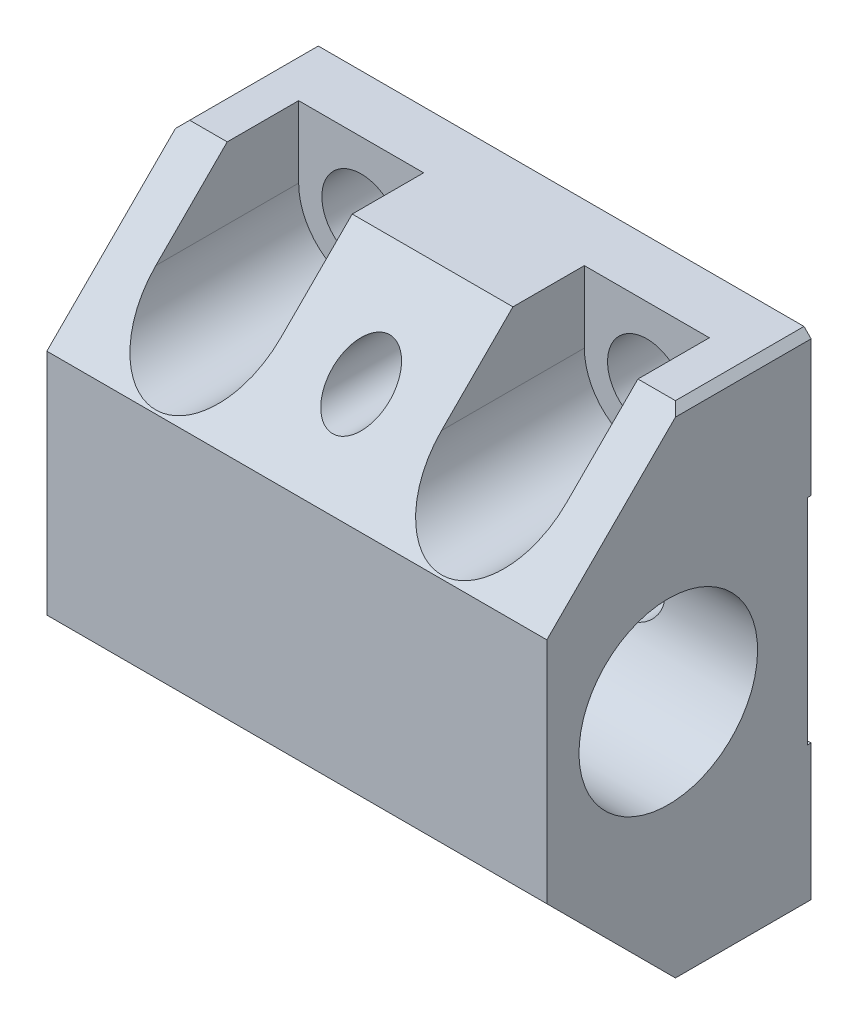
ISO-10303-21;
HEADER;
FILE_DESCRIPTION(('STEP AP214'),'2;1');
FILE_NAME('part.step','',(''),(''),'','','');
FILE_SCHEMA(('AUTOMOTIVE_DESIGN { 1 0 10303 214 1 1 1 1 }'));
ENDSEC;
DATA;
#1=APPLICATION_CONTEXT('core data for automotive mechanical design processes');
#2=APPLICATION_PROTOCOL_DEFINITION('international standard','automotive_design',2000,#1);
#3=PRODUCT_CONTEXT('',#1,'mechanical');
#4=PRODUCT('Part','Part','',(#3));
#5=PRODUCT_RELATED_PRODUCT_CATEGORY('part','',(#4));
#6=PRODUCT_DEFINITION_FORMATION('','',#4);
#7=PRODUCT_DEFINITION_CONTEXT('part definition',#1,'design');
#8=PRODUCT_DEFINITION('design','',#6,#7);
#9=PRODUCT_DEFINITION_SHAPE('','',#8);
#10=(LENGTH_UNIT() NAMED_UNIT(*) SI_UNIT(.MILLI.,.METRE.));
#11=(NAMED_UNIT(*) PLANE_ANGLE_UNIT() SI_UNIT($,.RADIAN.));
#12=(NAMED_UNIT(*) SI_UNIT($,.STERADIAN.) SOLID_ANGLE_UNIT());
#13=UNCERTAINTY_MEASURE_WITH_UNIT(LENGTH_MEASURE(1.E-05),#10,'distance_accuracy_value','');
#14=(GEOMETRIC_REPRESENTATION_CONTEXT(3) GLOBAL_UNCERTAINTY_ASSIGNED_CONTEXT((#13)) GLOBAL_UNIT_ASSIGNED_CONTEXT((#10,
#11,#12)) REPRESENTATION_CONTEXT('',''));
#15=CARTESIAN_POINT('',(0.,0.,0.));
#16=DIRECTION('',(0.,0.,1.));
#17=DIRECTION('',(1.,0.,0.));
#18=AXIS2_PLACEMENT_3D('',#15,#16,#17);
#19=CARTESIAN_POINT('',(-15.,-10.,0.));
#20=DIRECTION('',(0.,-1.,0.));
#21=DIRECTION('',(1.,0.,0.));
#22=AXIS2_PLACEMENT_3D('',#19,#20,#21);
#23=PLANE('',#22);
#24=DIRECTION('',(1.,0.,0.));
#25=VECTOR('',#24,1.);
#26=CARTESIAN_POINT('',(-15.,-10.,18.));
#27=LINE('',#26,#25);
#28=CARTESIAN_POINT('',(-14.,-10.,18.));
#29=VERTEX_POINT('',#28);
#30=CARTESIAN_POINT('',(-8.75,-10.,17.9999999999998));
#31=VERTEX_POINT('',#30);
#32=EDGE_CURVE('E299',#29,#31,#27,.T.);
#33=ORIENTED_EDGE('',*,*,#32,.F.);
#34=DIRECTION('',(0.,0.,-1.));
#35=VECTOR('',#34,1.);
#36=CARTESIAN_POINT('',(-14.,-10.,0.));
#37=LINE('',#36,#35);
#38=CARTESIAN_POINT('',(-14.,-10.,0.));
#39=VERTEX_POINT('',#38);
#40=EDGE_CURVE('E302',#29,#39,#37,.T.);
#41=ORIENTED_EDGE('',*,*,#40,.T.);
#42=DIRECTION('',(1.,0.,0.));
#43=VECTOR('',#42,1.);
#44=CARTESIAN_POINT('',(-15.,-10.,0.));
#45=LINE('',#44,#43);
#46=CARTESIAN_POINT('',(54.,-10.,0.));
#47=VERTEX_POINT('',#46);
#48=EDGE_CURVE('E404',#39,#47,#45,.T.);
#49=ORIENTED_EDGE('',*,*,#48,.T.);
#50=DIRECTION('',(0.,0.,1.));
#51=VECTOR('',#50,1.);
#52=CARTESIAN_POINT('',(54.,-10.,18.));
#53=LINE('',#52,#51);
#54=CARTESIAN_POINT('',(54.,-10.,18.));
#55=VERTEX_POINT('',#54);
#56=EDGE_CURVE('E320',#47,#55,#53,.T.);
#57=ORIENTED_EDGE('',*,*,#56,.T.);
#58=CARTESIAN_POINT('',(48.75,-10.,18.));
#59=VERTEX_POINT('',#58);
#60=EDGE_CURVE('E312',#59,#55,#27,.T.);
#61=ORIENTED_EDGE('',*,*,#60,.F.);
#62=DIRECTION('',(0.,0.,1.));
#63=VECTOR('',#62,1.);
#64=CARTESIAN_POINT('',(48.75,-10.,8.));
#65=LINE('',#64,#63);
#66=CARTESIAN_POINT('',(48.75,-10.,8.));
#67=VERTEX_POINT('',#66);
#68=EDGE_CURVE('E493',#67,#59,#65,.T.);
#69=ORIENTED_EDGE('',*,*,#68,.F.);
#70=DIRECTION('',(1.,0.,0.));
#71=VECTOR('',#70,1.);
#72=CARTESIAN_POINT('',(31.25,-10.,8.));
#73=LINE('',#72,#71);
#74=CARTESIAN_POINT('',(31.25,-10.,8.));
#75=VERTEX_POINT('',#74);
#76=EDGE_CURVE('E499',#75,#67,#73,.T.);
#77=ORIENTED_EDGE('',*,*,#76,.F.);
#78=DIRECTION('',(0.,0.,1.));
#79=VECTOR('',#78,1.);
#80=CARTESIAN_POINT('',(31.25,-10.,8.));
#81=LINE('',#80,#79);
#82=CARTESIAN_POINT('',(31.25,-10.,18.));
#83=VERTEX_POINT('',#82);
#84=EDGE_CURVE('E489',#75,#83,#81,.T.);
#85=ORIENTED_EDGE('',*,*,#84,.T.);
#86=CARTESIAN_POINT('',(8.75,-10.,17.9999999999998));
#87=VERTEX_POINT('',#86);
#88=EDGE_CURVE('E310',#87,#83,#27,.T.);
#89=ORIENTED_EDGE('',*,*,#88,.F.);
#90=DIRECTION('',(0.,0.,1.));
#91=VECTOR('',#90,1.);
#92=CARTESIAN_POINT('',(8.75,-10.,8.));
#93=LINE('',#92,#91);
#94=CARTESIAN_POINT('',(8.75,-10.,8.));
#95=VERTEX_POINT('',#94);
#96=EDGE_CURVE('E512',#95,#87,#93,.T.);
#97=ORIENTED_EDGE('',*,*,#96,.F.);
#98=DIRECTION('',(1.,0.,0.));
#99=VECTOR('',#98,1.);
#100=CARTESIAN_POINT('',(-8.75,-10.,8.));
#101=LINE('',#100,#99);
#102=CARTESIAN_POINT('',(-8.75,-10.,8.));
#103=VERTEX_POINT('',#102);
#104=EDGE_CURVE('E518',#103,#95,#101,.T.);
#105=ORIENTED_EDGE('',*,*,#104,.F.);
#106=DIRECTION('',(0.,0.,1.));
#107=VECTOR('',#106,1.);
#108=CARTESIAN_POINT('',(-8.75,-10.,8.));
#109=LINE('',#108,#107);
#110=EDGE_CURVE('E305',#103,#31,#109,.T.);
#111=ORIENTED_EDGE('',*,*,#110,.T.);
#112=EDGE_LOOP('',(#33,#41,#49,#57,#61,#69,#77,#85,#89,#97,#105,#111));
#113=FACE_BOUND('',#112,.T.);
#114=ADVANCED_FACE('F14',(#113),#23,.T.);
#115=CARTESIAN_POINT('',(-15.,9.,37.));
#116=DIRECTION('',(0.,-0.707106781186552,0.707106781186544));
#117=DIRECTION('',(0.,-0.707106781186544,-0.707106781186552));
#118=AXIS2_PLACEMENT_3D('',#115,#116,#117);
#119=PLANE('',#118);
#120=CARTESIAN_POINT('',(20.,0.,28.));
#121=DIRECTION('',(0.,-0.707106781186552,0.707106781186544));
#122=DIRECTION('',(0.,-0.707106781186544,-0.707106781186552));
#123=AXIS2_PLACEMENT_3D('',#120,#121,#122);
#124=ELLIPSE('',#123,5.65685424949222,3.99999999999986);
#125=CARTESIAN_POINT('',(20.,-3.99999999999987,24.0000000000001));
#126=VERTEX_POINT('',#125);
#127=EDGE_CURVE('E574',#126,#126,#124,.T.);
#128=ORIENTED_EDGE('',*,*,#127,.F.);
#129=EDGE_LOOP('',(#128));
#130=FACE_BOUND('',#129,.T.);
#131=DIRECTION('',(0.,-0.707106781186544,-0.707106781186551));
#132=VECTOR('',#131,1.);
#133=CARTESIAN_POINT('',(-15.,9.,37.));
#134=LINE('',#133,#132);
#135=CARTESIAN_POINT('',(-15.,9.,37.));
#136=VERTEX_POINT('',#135);
#137=CARTESIAN_POINT('',(-15.,-9.,19.));
#138=VERTEX_POINT('',#137);
#139=EDGE_CURVE('E401',#136,#138,#134,.T.);
#140=ORIENTED_EDGE('',*,*,#139,.T.);
#141=DIRECTION('',(-0.577350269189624,0.577350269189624,0.57735026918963));
#142=VECTOR('',#141,1.);
#143=CARTESIAN_POINT('',(-27.,3.,31.));
#144=LINE('',#143,#142);
#145=EDGE_CURVE('E317',#138,#29,#144,.F.);
#146=ORIENTED_EDGE('',*,*,#145,.T.);
#147=ORIENTED_EDGE('',*,*,#32,.T.);
#148=DIRECTION('',(0.,-0.707106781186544,-0.707106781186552));
#149=VECTOR('',#148,1.);
#150=CARTESIAN_POINT('',(-8.75,9.,37.));
#151=LINE('',#150,#149);
#152=CARTESIAN_POINT('',(-8.75,0.,28.));
#153=VERTEX_POINT('',#152);
#154=EDGE_CURVE('E783',#153,#31,#151,.T.);
#155=ORIENTED_EDGE('',*,*,#154,.F.);
#156=CARTESIAN_POINT('',(0.,0.,28.));
#157=DIRECTION('',(0.,-0.707106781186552,0.707106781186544));
#158=DIRECTION('',(0.,0.707106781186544,0.707106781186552));
#159=AXIS2_PLACEMENT_3D('',#156,#157,#158);
#160=ELLIPSE('',#159,12.3743686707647,8.75);
#161=CARTESIAN_POINT('',(8.75,0.,28.));
#162=VERTEX_POINT('',#161);
#163=EDGE_CURVE('E785',#162,#153,#160,.T.);
#164=ORIENTED_EDGE('',*,*,#163,.F.);
#165=DIRECTION('',(0.,0.707106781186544,0.707106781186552));
#166=VECTOR('',#165,1.);
#167=CARTESIAN_POINT('',(8.75,9.,37.));
#168=LINE('',#167,#166);
#169=EDGE_CURVE('E323',#87,#162,#168,.T.);
#170=ORIENTED_EDGE('',*,*,#169,.F.);
#171=ORIENTED_EDGE('',*,*,#88,.T.);
#172=DIRECTION('',(0.,-0.707106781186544,-0.707106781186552));
#173=VECTOR('',#172,1.);
#174=CARTESIAN_POINT('',(31.25,9.,37.));
#175=LINE('',#174,#173);
#176=CARTESIAN_POINT('',(31.25,0.,28.));
#177=VERTEX_POINT('',#176);
#178=EDGE_CURVE('E775',#177,#83,#175,.T.);
#179=ORIENTED_EDGE('',*,*,#178,.F.);
#180=CARTESIAN_POINT('',(40.,0.,28.));
#181=DIRECTION('',(0.,-0.707106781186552,0.707106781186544));
#182=DIRECTION('',(0.,0.707106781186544,0.707106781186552));
#183=AXIS2_PLACEMENT_3D('',#180,#181,#182);
#184=ELLIPSE('',#183,12.3743686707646,8.75);
#185=CARTESIAN_POINT('',(48.75,0.,28.));
#186=VERTEX_POINT('',#185);
#187=EDGE_CURVE('E778',#186,#177,#184,.T.);
#188=ORIENTED_EDGE('',*,*,#187,.F.);
#189=DIRECTION('',(0.,0.707106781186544,0.707106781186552));
#190=VECTOR('',#189,1.);
#191=CARTESIAN_POINT('',(48.75,9.,37.));
#192=LINE('',#191,#190);
#193=EDGE_CURVE('E781',#59,#186,#192,.T.);
#194=ORIENTED_EDGE('',*,*,#193,.F.);
#195=ORIENTED_EDGE('',*,*,#60,.T.);
#196=DIRECTION('',(0.577350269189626,0.577350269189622,0.577350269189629));
#197=VECTOR('',#196,1.);
#198=CARTESIAN_POINT('',(43.6666666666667,-20.3333333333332,7.66666666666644));
#199=LINE('',#198,#197);
#200=CARTESIAN_POINT('',(55.,-9.,19.));
#201=VERTEX_POINT('',#200);
#202=EDGE_CURVE('E332',#55,#201,#199,.T.);
#203=ORIENTED_EDGE('',*,*,#202,.T.);
#204=DIRECTION('',(0.,-0.707106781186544,-0.707106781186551));
#205=VECTOR('',#204,1.);
#206=CARTESIAN_POINT('',(55.,9.,37.));
#207=LINE('',#206,#205);
#208=CARTESIAN_POINT('',(55.,9.,37.));
#209=VERTEX_POINT('',#208);
#210=EDGE_CURVE('E423',#209,#201,#207,.T.);
#211=ORIENTED_EDGE('',*,*,#210,.F.);
#212=DIRECTION('',(1.,0.,0.));
#213=VECTOR('',#212,1.);
#214=CARTESIAN_POINT('',(-15.,9.,37.));
#215=LINE('',#214,#213);
#216=EDGE_CURVE('E396',#136,#209,#215,.T.);
#217=ORIENTED_EDGE('',*,*,#216,.F.);
#218=EDGE_LOOP('',(#140,#146,#147,#155,#164,#170,#171,#179,#188,#194,#195,#203,#211,#217));
#219=FACE_BOUND('',#218,.T.);
#220=ADVANCED_FACE('F287',(#130,#219),#119,.T.);
#221=CARTESIAN_POINT('',(-15.,9.,37.));
#222=DIRECTION('',(0.,0.,1.));
#223=DIRECTION('',(1.,0.,0.));
#224=AXIS2_PLACEMENT_3D('',#221,#222,#223);
#225=PLANE('',#224);
#226=DIRECTION('',(0.,-1.,0.));
#227=VECTOR('',#226,1.);
#228=CARTESIAN_POINT('',(55.,9.,37.));
#229=LINE('',#228,#227);
#230=CARTESIAN_POINT('',(55.,41.,37.));
#231=VERTEX_POINT('',#230);
#232=EDGE_CURVE('E425',#231,#209,#229,.T.);
#233=ORIENTED_EDGE('',*,*,#232,.F.);
#234=DIRECTION('',(1.,0.,0.));
#235=VECTOR('',#234,1.);
#236=CARTESIAN_POINT('',(-15.,41.,37.));
#237=LINE('',#236,#235);
#238=CARTESIAN_POINT('',(-15.,41.,37.));
#239=VERTEX_POINT('',#238);
#240=EDGE_CURVE('E393',#239,#231,#237,.T.);
#241=ORIENTED_EDGE('',*,*,#240,.F.);
#242=DIRECTION('',(0.,-1.,0.));
#243=VECTOR('',#242,1.);
#244=CARTESIAN_POINT('',(-15.,9.,37.));
#245=LINE('',#244,#243);
#246=EDGE_CURVE('E405',#239,#136,#245,.T.);
#247=ORIENTED_EDGE('',*,*,#246,.T.);
#248=ORIENTED_EDGE('',*,*,#216,.T.);
#249=EDGE_LOOP('',(#233,#241,#247,#248));
#250=FACE_BOUND('',#249,.T.);
#251=ADVANCED_FACE('F293',(#250),#225,.T.);
#252=CARTESIAN_POINT('',(-15.,41.,37.));
#253=DIRECTION('',(0.,0.707106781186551,0.707106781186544));
#254=DIRECTION('',(0.,-0.707106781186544,0.707106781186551));
#255=AXIS2_PLACEMENT_3D('',#252,#253,#254);
#256=PLANE('',#255);
#257=CARTESIAN_POINT('',(20.,50.,28.));
#258=DIRECTION('',(0.,0.707106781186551,0.707106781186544));
#259=DIRECTION('',(0.,0.707106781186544,-0.707106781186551));
#260=AXIS2_PLACEMENT_3D('',#257,#258,#259);
#261=ELLIPSE('',#260,5.65685424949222,3.99999999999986);
#262=CARTESIAN_POINT('',(20.,53.9999999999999,24.0000000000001));
#263=VERTEX_POINT('',#262);
#264=EDGE_CURVE('E566',#263,#263,#261,.T.);
#265=ORIENTED_EDGE('',*,*,#264,.F.);
#266=EDGE_LOOP('',(#265));
#267=FACE_BOUND('',#266,.T.);
#268=DIRECTION('',(1.,0.,0.));
#269=VECTOR('',#268,1.);
#270=CARTESIAN_POINT('',(-15.,60.,18.));
#271=LINE('',#270,#269);
#272=CARTESIAN_POINT('',(-14.,60.,18.));
#273=VERTEX_POINT('',#272);
#274=CARTESIAN_POINT('',(-8.75,60.,18.));
#275=VERTEX_POINT('',#274);
#276=EDGE_CURVE('E389',#273,#275,#271,.T.);
#277=ORIENTED_EDGE('',*,*,#276,.F.);
#278=DIRECTION('',(0.577350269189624,0.577350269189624,-0.57735026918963));
#279=VECTOR('',#278,1.);
#280=CARTESIAN_POINT('',(-27.,47.,31.));
#281=LINE('',#280,#279);
#282=CARTESIAN_POINT('',(-15.,59.,19.));
#283=VERTEX_POINT('',#282);
#284=EDGE_CURVE('E348',#273,#283,#281,.F.);
#285=ORIENTED_EDGE('',*,*,#284,.T.);
#286=DIRECTION('',(0.,-0.707106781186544,0.707106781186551));
#287=VECTOR('',#286,1.);
#288=CARTESIAN_POINT('',(-15.,41.,37.));
#289=LINE('',#288,#287);
#290=EDGE_CURVE('E408',#283,#239,#289,.T.);
#291=ORIENTED_EDGE('',*,*,#290,.T.);
#292=ORIENTED_EDGE('',*,*,#240,.T.);
#293=DIRECTION('',(0.,-0.707106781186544,0.707106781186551));
#294=VECTOR('',#293,1.);
#295=CARTESIAN_POINT('',(55.,41.,37.));
#296=LINE('',#295,#294);
#297=CARTESIAN_POINT('',(55.,59.,19.));
#298=VERTEX_POINT('',#297);
#299=EDGE_CURVE('E370',#298,#231,#296,.T.);
#300=ORIENTED_EDGE('',*,*,#299,.F.);
#301=DIRECTION('',(-0.577350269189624,0.577350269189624,-0.57735026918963));
#302=VECTOR('',#301,1.);
#303=CARTESIAN_POINT('',(43.6666666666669,70.3333333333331,7.66666666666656));
#304=LINE('',#303,#302);
#305=CARTESIAN_POINT('',(54.,60.,18.));
#306=VERTEX_POINT('',#305);
#307=EDGE_CURVE('E346',#298,#306,#304,.T.);
#308=ORIENTED_EDGE('',*,*,#307,.T.);
#309=CARTESIAN_POINT('',(48.75,60.,18.));
#310=VERTEX_POINT('',#309);
#311=EDGE_CURVE('E379',#310,#306,#271,.T.);
#312=ORIENTED_EDGE('',*,*,#311,.F.);
#313=DIRECTION('',(0.,0.707106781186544,-0.707106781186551));
#314=VECTOR('',#313,1.);
#315=CARTESIAN_POINT('',(48.75,41.,37.));
#316=LINE('',#315,#314);
#317=CARTESIAN_POINT('',(48.75,50.,28.));
#318=VERTEX_POINT('',#317);
#319=EDGE_CURVE('E439',#318,#310,#316,.T.);
#320=ORIENTED_EDGE('',*,*,#319,.F.);
#321=CARTESIAN_POINT('',(40.,50.,28.));
#322=DIRECTION('',(0.,0.707106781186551,0.707106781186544));
#323=DIRECTION('',(0.,-0.707106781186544,0.707106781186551));
#324=AXIS2_PLACEMENT_3D('',#321,#322,#323);
#325=ELLIPSE('',#324,12.3743686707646,8.75);
#326=CARTESIAN_POINT('',(31.25,50.,28.));
#327=VERTEX_POINT('',#326);
#328=EDGE_CURVE('E309',#327,#318,#325,.T.);
#329=ORIENTED_EDGE('',*,*,#328,.F.);
#330=DIRECTION('',(0.,-0.707106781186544,0.707106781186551));
#331=VECTOR('',#330,1.);
#332=CARTESIAN_POINT('',(31.25,41.,37.));
#333=LINE('',#332,#331);
#334=CARTESIAN_POINT('',(31.25,60.,18.));
#335=VERTEX_POINT('',#334);
#336=EDGE_CURVE('E437',#335,#327,#333,.T.);
#337=ORIENTED_EDGE('',*,*,#336,.F.);
#338=CARTESIAN_POINT('',(8.75,60.,18.));
#339=VERTEX_POINT('',#338);
#340=EDGE_CURVE('E387',#339,#335,#271,.T.);
#341=ORIENTED_EDGE('',*,*,#340,.F.);
#342=DIRECTION('',(0.,0.707106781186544,-0.707106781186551));
#343=VECTOR('',#342,1.);
#344=CARTESIAN_POINT('',(8.75,41.,37.));
#345=LINE('',#344,#343);
#346=CARTESIAN_POINT('',(8.75,50.,28.));
#347=VERTEX_POINT('',#346);
#348=EDGE_CURVE('E463',#347,#339,#345,.T.);
#349=ORIENTED_EDGE('',*,*,#348,.F.);
#350=CARTESIAN_POINT('',(0.,50.,28.));
#351=DIRECTION('',(0.,0.707106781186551,0.707106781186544));
#352=DIRECTION('',(0.,-0.707106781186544,0.707106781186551));
#353=AXIS2_PLACEMENT_3D('',#350,#351,#352);
#354=ELLIPSE('',#353,12.3743686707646,8.75);
#355=CARTESIAN_POINT('',(-8.75,50.,28.));
#356=VERTEX_POINT('',#355);
#357=EDGE_CURVE('E773',#356,#347,#354,.T.);
#358=ORIENTED_EDGE('',*,*,#357,.F.);
#359=DIRECTION('',(0.,-0.707106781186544,0.707106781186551));
#360=VECTOR('',#359,1.);
#361=CARTESIAN_POINT('',(-8.75,41.,37.));
#362=LINE('',#361,#360);
#363=EDGE_CURVE('E461',#275,#356,#362,.T.);
#364=ORIENTED_EDGE('',*,*,#363,.F.);
#365=EDGE_LOOP('',(#277,#285,#291,#292,#300,#308,#312,#320,#329,#337,#341,#349,#358,#364));
#366=FACE_BOUND('',#365,.T.);
#367=ADVANCED_FACE('F377',(#267,#366),#256,.T.);
#368=CARTESIAN_POINT('',(-15.,60.,0.));
#369=DIRECTION('',(0.,1.,0.));
#370=DIRECTION('',(-1.,0.,0.));
#371=AXIS2_PLACEMENT_3D('',#368,#369,#370);
#372=PLANE('',#371);
#373=DIRECTION('',(1.,0.,0.));
#374=VECTOR('',#373,1.);
#375=CARTESIAN_POINT('',(-15.,60.,0.));
#376=LINE('',#375,#374);
#377=CARTESIAN_POINT('',(-14.,60.,0.));
#378=VERTEX_POINT('',#377);
#379=CARTESIAN_POINT('',(54.,60.,0.));
#380=VERTEX_POINT('',#379);
#381=EDGE_CURVE('E359',#378,#380,#376,.T.);
#382=ORIENTED_EDGE('',*,*,#381,.F.);
#383=DIRECTION('',(0.,0.,1.));
#384=VECTOR('',#383,1.);
#385=CARTESIAN_POINT('',(-14.,60.,0.));
#386=LINE('',#385,#384);
#387=EDGE_CURVE('E343',#378,#273,#386,.T.);
#388=ORIENTED_EDGE('',*,*,#387,.T.);
#389=ORIENTED_EDGE('',*,*,#276,.T.);
#390=DIRECTION('',(0.,0.,1.));
#391=VECTOR('',#390,1.);
#392=CARTESIAN_POINT('',(-8.75,60.,8.));
#393=LINE('',#392,#391);
#394=CARTESIAN_POINT('',(-8.75,60.,8.));
#395=VERTEX_POINT('',#394);
#396=EDGE_CURVE('E473',#395,#275,#393,.T.);
#397=ORIENTED_EDGE('',*,*,#396,.F.);
#398=DIRECTION('',(-1.,0.,0.));
#399=VECTOR('',#398,1.);
#400=CARTESIAN_POINT('',(-8.75,60.,8.));
#401=LINE('',#400,#399);
#402=CARTESIAN_POINT('',(8.75,60.,8.));
#403=VERTEX_POINT('',#402);
#404=EDGE_CURVE('E479',#403,#395,#401,.T.);
#405=ORIENTED_EDGE('',*,*,#404,.F.);
#406=DIRECTION('',(0.,0.,1.));
#407=VECTOR('',#406,1.);
#408=CARTESIAN_POINT('',(8.75,60.,8.));
#409=LINE('',#408,#407);
#410=EDGE_CURVE('E469',#403,#339,#409,.T.);
#411=ORIENTED_EDGE('',*,*,#410,.T.);
#412=ORIENTED_EDGE('',*,*,#340,.T.);
#413=DIRECTION('',(0.,0.,1.));
#414=VECTOR('',#413,1.);
#415=CARTESIAN_POINT('',(31.25,60.,8.));
#416=LINE('',#415,#414);
#417=CARTESIAN_POINT('',(31.25,60.,8.));
#418=VERTEX_POINT('',#417);
#419=EDGE_CURVE('E447',#418,#335,#416,.T.);
#420=ORIENTED_EDGE('',*,*,#419,.F.);
#421=DIRECTION('',(-1.,0.,0.));
#422=VECTOR('',#421,1.);
#423=CARTESIAN_POINT('',(31.25,60.,8.));
#424=LINE('',#423,#422);
#425=CARTESIAN_POINT('',(48.75,60.,8.));
#426=VERTEX_POINT('',#425);
#427=EDGE_CURVE('E454',#426,#418,#424,.T.);
#428=ORIENTED_EDGE('',*,*,#427,.F.);
#429=DIRECTION('',(0.,0.,1.));
#430=VECTOR('',#429,1.);
#431=CARTESIAN_POINT('',(48.75,60.,8.));
#432=LINE('',#431,#430);
#433=EDGE_CURVE('E386',#426,#310,#432,.T.);
#434=ORIENTED_EDGE('',*,*,#433,.T.);
#435=ORIENTED_EDGE('',*,*,#311,.T.);
#436=DIRECTION('',(0.,0.,-1.));
#437=VECTOR('',#436,1.);
#438=CARTESIAN_POINT('',(54.,60.,0.));
#439=LINE('',#438,#437);
#440=EDGE_CURVE('E341',#306,#380,#439,.T.);
#441=ORIENTED_EDGE('',*,*,#440,.T.);
#442=EDGE_LOOP('',(#382,#388,#389,#397,#405,#411,#412,#420,#428,#434,#435,#441));
#443=FACE_BOUND('',#442,.T.);
#444=ADVANCED_FACE('F383',(#443),#372,.T.);
#445=CARTESIAN_POINT('',(-15.,40.,0.));
#446=DIRECTION('',(0.,0.,-1.));
#447=DIRECTION('',(0.,1.,0.));
#448=AXIS2_PLACEMENT_3D('',#445,#446,#447);
#449=PLANE('',#448);
#450=CARTESIAN_POINT('',(20.,50.,0.));
#451=DIRECTION('',(0.,0.,-1.));
#452=DIRECTION('',(-1.,0.,0.));
#453=AXIS2_PLACEMENT_3D('',#450,#451,#452);
#454=CIRCLE('',#453,4.);
#455=CARTESIAN_POINT('',(16.,50.,0.));
#456=VERTEX_POINT('',#455);
#457=EDGE_CURVE('E571',#456,#456,#454,.T.);
#458=ORIENTED_EDGE('',*,*,#457,.F.);
#459=EDGE_LOOP('',(#458));
#460=FACE_BOUND('',#459,.T.);
#461=CARTESIAN_POINT('',(0.,50.,0.));
#462=DIRECTION('',(0.,0.,-1.));
#463=DIRECTION('',(0.,1.,0.));
#464=AXIS2_PLACEMENT_3D('',#461,#462,#463);
#465=CIRCLE('',#464,5.5);
#466=CARTESIAN_POINT('',(0.,55.5,0.));
#467=VERTEX_POINT('',#466);
#468=EDGE_CURVE('E551',#467,#467,#465,.F.);
#469=ORIENTED_EDGE('',*,*,#468,.T.);
#470=EDGE_LOOP('',(#469));
#471=FACE_BOUND('',#470,.T.);
#472=CARTESIAN_POINT('',(40.,50.,0.));
#473=DIRECTION('',(0.,0.,-1.));
#474=DIRECTION('',(0.,1.,0.));
#475=AXIS2_PLACEMENT_3D('',#472,#473,#474);
#476=CIRCLE('',#475,5.5);
#477=CARTESIAN_POINT('',(40.,55.5,0.));
#478=VERTEX_POINT('',#477);
#479=EDGE_CURVE('E545',#478,#478,#476,.F.);
#480=ORIENTED_EDGE('',*,*,#479,.T.);
#481=EDGE_LOOP('',(#480));
#482=FACE_BOUND('',#481,.T.);
#483=DIRECTION('',(0.,1.,0.));
#484=VECTOR('',#483,1.);
#485=CARTESIAN_POINT('',(-15.,40.,0.));
#486=LINE('',#485,#484);
#487=CARTESIAN_POINT('',(-15.,40.,0.));
#488=VERTEX_POINT('',#487);
#489=CARTESIAN_POINT('',(-15.,59.,0.));
#490=VERTEX_POINT('',#489);
#491=EDGE_CURVE('E410',#488,#490,#486,.T.);
#492=ORIENTED_EDGE('',*,*,#491,.T.);
#493=DIRECTION('',(-0.707106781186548,-0.707106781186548,0.));
#494=VECTOR('',#493,1.);
#495=CARTESIAN_POINT('',(-24.5,49.5,0.));
#496=LINE('',#495,#494);
#497=EDGE_CURVE('E9',#490,#378,#496,.F.);
#498=ORIENTED_EDGE('',*,*,#497,.T.);
#499=ORIENTED_EDGE('',*,*,#381,.T.);
#500=DIRECTION('',(0.707106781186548,-0.707106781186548,0.));
#501=VECTOR('',#500,1.);
#502=CARTESIAN_POINT('',(29.5,84.5,0.));
#503=LINE('',#502,#501);
#504=CARTESIAN_POINT('',(55.,59.,0.));
#505=VERTEX_POINT('',#504);
#506=EDGE_CURVE('E21',#380,#505,#503,.T.);
#507=ORIENTED_EDGE('',*,*,#506,.T.);
#508=DIRECTION('',(0.,1.,0.));
#509=VECTOR('',#508,1.);
#510=CARTESIAN_POINT('',(55.,40.,0.));
#511=LINE('',#510,#509);
#512=CARTESIAN_POINT('',(55.,40.,0.));
#513=VERTEX_POINT('',#512);
#514=EDGE_CURVE('E356',#513,#505,#511,.T.);
#515=ORIENTED_EDGE('',*,*,#514,.F.);
#516=DIRECTION('',(1.,0.,0.));
#517=VECTOR('',#516,1.);
#518=CARTESIAN_POINT('',(-15.,40.,0.));
#519=LINE('',#518,#517);
#520=EDGE_CURVE('E390',#488,#513,#519,.T.);
#521=ORIENTED_EDGE('',*,*,#520,.F.);
#522=EDGE_LOOP('',(#492,#498,#499,#507,#515,#521));
#523=FACE_BOUND('',#522,.T.);
#524=ADVANCED_FACE('F355',(#460,#471,#482,#523),#449,.T.);
#525=CARTESIAN_POINT('',(-15.,40.,0.));
#526=DIRECTION('',(0.,-1.,0.));
#527=DIRECTION('',(1.,0.,0.));
#528=AXIS2_PLACEMENT_3D('',#525,#526,#527);
#529=PLANE('',#528);
#530=DIRECTION('',(0.,0.,-1.));
#531=VECTOR('',#530,1.);
#532=CARTESIAN_POINT('',(55.,40.,0.));
#533=LINE('',#532,#531);
#534=CARTESIAN_POINT('',(55.,40.,0.500000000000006));
#535=VERTEX_POINT('',#534);
#536=EDGE_CURVE('E369',#535,#513,#533,.T.);
#537=ORIENTED_EDGE('',*,*,#536,.F.);
#538=DIRECTION('',(1.,0.,0.));
#539=VECTOR('',#538,1.);
#540=CARTESIAN_POINT('',(-15.,40.,0.500000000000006));
#541=LINE('',#540,#539);
#542=CARTESIAN_POINT('',(-15.,40.,0.500000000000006));
#543=VERTEX_POINT('',#542);
#544=EDGE_CURVE('E810',#543,#535,#541,.T.);
#545=ORIENTED_EDGE('',*,*,#544,.F.);
#546=DIRECTION('',(0.,0.,-1.));
#547=VECTOR('',#546,1.);
#548=CARTESIAN_POINT('',(-15.,40.,0.));
#549=LINE('',#548,#547);
#550=EDGE_CURVE('E412',#543,#488,#549,.T.);
#551=ORIENTED_EDGE('',*,*,#550,.T.);
#552=ORIENTED_EDGE('',*,*,#520,.T.);
#553=EDGE_LOOP('',(#537,#545,#551,#552));
#554=FACE_BOUND('',#553,.T.);
#555=ADVANCED_FACE('F741',(#554),#529,.T.);
#556=CARTESIAN_POINT('',(-15.,10.,0.5));
#557=DIRECTION('',(0.,0.,-1.));
#558=DIRECTION('',(0.,1.,0.));
#559=AXIS2_PLACEMENT_3D('',#556,#557,#558);
#560=PLANE('',#559);
#561=CARTESIAN_POINT('',(37.5,25.,0.5));
#562=DIRECTION('',(0.,0.,-1.));
#563=DIRECTION('',(0.,1.,0.));
#564=AXIS2_PLACEMENT_3D('',#561,#562,#563);
#565=CIRCLE('',#564,4.5);
#566=CARTESIAN_POINT('',(37.5,29.5,0.5));
#567=VERTEX_POINT('',#566);
#568=CARTESIAN_POINT('',(37.5,20.5,0.5));
#569=VERTEX_POINT('',#568);
#570=EDGE_CURVE('E28',#567,#569,#565,.T.);
#571=ORIENTED_EDGE('',*,*,#570,.F.);
#572=DIRECTION('',(1.,0.,0.));
#573=VECTOR('',#572,1.);
#574=CARTESIAN_POINT('',(37.5,29.5,0.5));
#575=LINE('',#574,#573);
#576=CARTESIAN_POINT('',(19.5,29.5,0.5));
#577=VERTEX_POINT('',#576);
#578=EDGE_CURVE('E241',#577,#567,#575,.T.);
#579=ORIENTED_EDGE('',*,*,#578,.F.);
#580=CARTESIAN_POINT('',(19.5,25.,0.5));
#581=DIRECTION('',(0.,0.,-1.));
#582=DIRECTION('',(0.,-1.,0.));
#583=AXIS2_PLACEMENT_3D('',#580,#581,#582);
#584=CIRCLE('',#583,4.5);
#585=CARTESIAN_POINT('',(19.5,20.5,0.5));
#586=VERTEX_POINT('',#585);
#587=EDGE_CURVE('E585',#586,#577,#584,.T.);
#588=ORIENTED_EDGE('',*,*,#587,.F.);
#589=DIRECTION('',(-1.,0.,0.));
#590=VECTOR('',#589,1.);
#591=CARTESIAN_POINT('',(37.5,20.5,0.5));
#592=LINE('',#591,#590);
#593=EDGE_CURVE('E255',#569,#586,#592,.T.);
#594=ORIENTED_EDGE('',*,*,#593,.F.);
#595=EDGE_LOOP('',(#571,#579,#588,#594));
#596=FACE_BOUND('',#595,.T.);
#597=DIRECTION('',(0.,1.,0.));
#598=VECTOR('',#597,1.);
#599=CARTESIAN_POINT('',(55.,10.,0.5));
#600=LINE('',#599,#598);
#601=CARTESIAN_POINT('',(55.,10.,0.5));
#602=VERTEX_POINT('',#601);
#603=EDGE_CURVE('E430',#602,#535,#600,.T.);
#604=ORIENTED_EDGE('',*,*,#603,.F.);
#605=DIRECTION('',(1.,0.,0.));
#606=VECTOR('',#605,1.);
#607=CARTESIAN_POINT('',(-15.,10.,0.5));
#608=LINE('',#607,#606);
#609=CARTESIAN_POINT('',(-15.,10.,0.5));
#610=VERTEX_POINT('',#609);
#611=EDGE_CURVE('E768',#610,#602,#608,.T.);
#612=ORIENTED_EDGE('',*,*,#611,.F.);
#613=DIRECTION('',(0.,1.,0.));
#614=VECTOR('',#613,1.);
#615=CARTESIAN_POINT('',(-15.,10.,0.5));
#616=LINE('',#615,#614);
#617=EDGE_CURVE('E415',#610,#543,#616,.T.);
#618=ORIENTED_EDGE('',*,*,#617,.T.);
#619=ORIENTED_EDGE('',*,*,#544,.T.);
#620=EDGE_LOOP('',(#604,#612,#618,#619));
#621=FACE_BOUND('',#620,.T.);
#622=ADVANCED_FACE('F590',(#596,#621),#560,.T.);
#623=CARTESIAN_POINT('',(-15.,10.,0.));
#624=DIRECTION('',(0.,1.,0.));
#625=DIRECTION('',(-1.,0.,0.));
#626=AXIS2_PLACEMENT_3D('',#623,#624,#625);
#627=PLANE('',#626);
#628=DIRECTION('',(0.,0.,1.));
#629=VECTOR('',#628,1.);
#630=CARTESIAN_POINT('',(55.,10.,0.));
#631=LINE('',#630,#629);
#632=CARTESIAN_POINT('',(55.,10.,0.));
#633=VERTEX_POINT('',#632);
#634=EDGE_CURVE('E432',#633,#602,#631,.T.);
#635=ORIENTED_EDGE('',*,*,#634,.F.);
#636=DIRECTION('',(1.,0.,0.));
#637=VECTOR('',#636,1.);
#638=CARTESIAN_POINT('',(-15.,10.,0.));
#639=LINE('',#638,#637);
#640=CARTESIAN_POINT('',(-15.,10.,0.));
#641=VERTEX_POINT('',#640);
#642=EDGE_CURVE('E765',#641,#633,#639,.T.);
#643=ORIENTED_EDGE('',*,*,#642,.F.);
#644=DIRECTION('',(0.,0.,1.));
#645=VECTOR('',#644,1.);
#646=CARTESIAN_POINT('',(-15.,10.,0.));
#647=LINE('',#646,#645);
#648=EDGE_CURVE('E418',#641,#610,#647,.T.);
#649=ORIENTED_EDGE('',*,*,#648,.T.);
#650=ORIENTED_EDGE('',*,*,#611,.T.);
#651=EDGE_LOOP('',(#635,#643,#649,#650));
#652=FACE_BOUND('',#651,.T.);
#653=ADVANCED_FACE('F748',(#652),#627,.T.);
#654=CARTESIAN_POINT('',(-15.,-10.,0.));
#655=DIRECTION('',(0.,0.,-1.));
#656=DIRECTION('',(-1.,0.,0.));
#657=AXIS2_PLACEMENT_3D('',#654,#655,#656);
#658=PLANE('',#657);
#659=CARTESIAN_POINT('',(20.,0.,0.));
#660=DIRECTION('',(0.,0.,-1.));
#661=DIRECTION('',(-1.,0.,0.));
#662=AXIS2_PLACEMENT_3D('',#659,#660,#661);
#663=CIRCLE('',#662,4.);
#664=CARTESIAN_POINT('',(16.,0.,0.));
#665=VERTEX_POINT('',#664);
#666=EDGE_CURVE('E247',#665,#665,#663,.T.);
#667=ORIENTED_EDGE('',*,*,#666,.F.);
#668=EDGE_LOOP('',(#667));
#669=FACE_BOUND('',#668,.T.);
#670=CARTESIAN_POINT('',(0.,0.,0.));
#671=DIRECTION('',(0.,0.,-1.));
#672=DIRECTION('',(-1.,0.,0.));
#673=AXIS2_PLACEMENT_3D('',#670,#671,#672);
#674=CIRCLE('',#673,5.5);
#675=CARTESIAN_POINT('',(-5.5,0.,0.));
#676=VERTEX_POINT('',#675);
#677=EDGE_CURVE('E563',#676,#676,#674,.F.);
#678=ORIENTED_EDGE('',*,*,#677,.T.);
#679=EDGE_LOOP('',(#678));
#680=FACE_BOUND('',#679,.T.);
#681=CARTESIAN_POINT('',(40.,0.,0.));
#682=DIRECTION('',(0.,0.,-1.));
#683=DIRECTION('',(-1.,0.,0.));
#684=AXIS2_PLACEMENT_3D('',#681,#682,#683);
#685=CIRCLE('',#684,5.5);
#686=CARTESIAN_POINT('',(34.5,0.,0.));
#687=VERTEX_POINT('',#686);
#688=EDGE_CURVE('E557',#687,#687,#685,.F.);
#689=ORIENTED_EDGE('',*,*,#688,.T.);
#690=EDGE_LOOP('',(#689));
#691=FACE_BOUND('',#690,.T.);
#692=ORIENTED_EDGE('',*,*,#48,.F.);
#693=DIRECTION('',(0.707106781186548,-0.707106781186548,0.));
#694=VECTOR('',#693,1.);
#695=CARTESIAN_POINT('',(-14.5,-9.5,0.));
#696=LINE('',#695,#694);
#697=CARTESIAN_POINT('',(-15.,-9.,0.));
#698=VERTEX_POINT('',#697);
#699=EDGE_CURVE('E318',#39,#698,#696,.F.);
#700=ORIENTED_EDGE('',*,*,#699,.T.);
#701=DIRECTION('',(0.,1.,0.));
#702=VECTOR('',#701,1.);
#703=CARTESIAN_POINT('',(-15.,-10.,0.));
#704=LINE('',#703,#702);
#705=EDGE_CURVE('E421',#698,#641,#704,.T.);
#706=ORIENTED_EDGE('',*,*,#705,.T.);
#707=ORIENTED_EDGE('',*,*,#642,.T.);
#708=DIRECTION('',(0.,1.,0.));
#709=VECTOR('',#708,1.);
#710=CARTESIAN_POINT('',(55.,-10.,0.));
#711=LINE('',#710,#709);
#712=CARTESIAN_POINT('',(55.,-9.,0.));
#713=VERTEX_POINT('',#712);
#714=EDGE_CURVE('E435',#713,#633,#711,.T.);
#715=ORIENTED_EDGE('',*,*,#714,.F.);
#716=DIRECTION('',(-0.70710678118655,-0.707106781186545,0.));
#717=VECTOR('',#716,1.);
#718=CARTESIAN_POINT('',(19.5,-44.5,0.));
#719=LINE('',#718,#717);
#720=EDGE_CURVE('E319',#713,#47,#719,.T.);
#721=ORIENTED_EDGE('',*,*,#720,.T.);
#722=EDGE_LOOP('',(#692,#700,#706,#707,#715,#721));
#723=FACE_BOUND('',#722,.T.);
#724=ADVANCED_FACE('F728',(#669,#680,#691,#723),#658,.T.);
#725=CARTESIAN_POINT('',(-15.,-10.,37.));
#726=DIRECTION('',(-1.,0.,0.));
#727=DIRECTION('',(0.,-1.,0.));
#728=AXIS2_PLACEMENT_3D('',#725,#726,#727);
#729=PLANE('',#728);
#730=CARTESIAN_POINT('',(-15.,25.,20.));
#731=DIRECTION('',(-1.,0.,0.));
#732=DIRECTION('',(0.,-1.,0.));
#733=AXIS2_PLACEMENT_3D('',#730,#731,#732);
#734=CIRCLE('',#733,9.);
#735=CARTESIAN_POINT('',(-15.,16.,20.));
#736=VERTEX_POINT('',#735);
#737=EDGE_CURVE('E535',#736,#736,#734,.T.);
#738=ORIENTED_EDGE('',*,*,#737,.F.);
#739=EDGE_LOOP('',(#738));
#740=FACE_BOUND('',#739,.T.);
#741=ORIENTED_EDGE('',*,*,#705,.F.);
#742=DIRECTION('',(0.,0.,1.));
#743=VECTOR('',#742,1.);
#744=CARTESIAN_POINT('',(-15.,-9.,37.));
#745=LINE('',#744,#743);
#746=EDGE_CURVE('E330',#698,#138,#745,.T.);
#747=ORIENTED_EDGE('',*,*,#746,.T.);
#748=ORIENTED_EDGE('',*,*,#139,.F.);
#749=ORIENTED_EDGE('',*,*,#246,.F.);
#750=ORIENTED_EDGE('',*,*,#290,.F.);
#751=DIRECTION('',(0.,0.,-1.));
#752=VECTOR('',#751,1.);
#753=CARTESIAN_POINT('',(-15.,59.,37.));
#754=LINE('',#753,#752);
#755=EDGE_CURVE('E328',#283,#490,#754,.T.);
#756=ORIENTED_EDGE('',*,*,#755,.T.);
#757=ORIENTED_EDGE('',*,*,#491,.F.);
#758=ORIENTED_EDGE('',*,*,#550,.F.);
#759=ORIENTED_EDGE('',*,*,#617,.F.);
#760=ORIENTED_EDGE('',*,*,#648,.F.);
#761=EDGE_LOOP('',(#741,#747,#748,#749,#750,#756,#757,#758,#759,#760));
#762=FACE_BOUND('',#761,.T.);
#763=ADVANCED_FACE('F725',(#740,#762),#729,.T.);
#764=CARTESIAN_POINT('',(55.,-10.,37.));
#765=DIRECTION('',(-1.,0.,0.));
#766=DIRECTION('',(0.,-1.,0.));
#767=AXIS2_PLACEMENT_3D('',#764,#765,#766);
#768=PLANE('',#767);
#769=CARTESIAN_POINT('',(55.,25.,20.));
#770=DIRECTION('',(1.,0.,0.));
#771=DIRECTION('',(0.,1.,0.));
#772=AXIS2_PLACEMENT_3D('',#769,#770,#771);
#773=CIRCLE('',#772,12.5);
#774=CARTESIAN_POINT('',(55.,37.5,20.));
#775=VERTEX_POINT('',#774);
#776=EDGE_CURVE('E529',#775,#775,#773,.T.);
#777=ORIENTED_EDGE('',*,*,#776,.F.);
#778=EDGE_LOOP('',(#777));
#779=FACE_BOUND('',#778,.T.);
#780=ORIENTED_EDGE('',*,*,#210,.T.);
#781=DIRECTION('',(0.,0.,-1.));
#782=VECTOR('',#781,1.);
#783=CARTESIAN_POINT('',(55.,-9.,0.));
#784=LINE('',#783,#782);
#785=EDGE_CURVE('E338',#201,#713,#784,.T.);
#786=ORIENTED_EDGE('',*,*,#785,.T.);
#787=ORIENTED_EDGE('',*,*,#714,.T.);
#788=ORIENTED_EDGE('',*,*,#634,.T.);
#789=ORIENTED_EDGE('',*,*,#603,.T.);
#790=ORIENTED_EDGE('',*,*,#536,.T.);
#791=ORIENTED_EDGE('',*,*,#514,.T.);
#792=DIRECTION('',(0.,0.,1.));
#793=VECTOR('',#792,1.);
#794=CARTESIAN_POINT('',(55.,59.,18.));
#795=LINE('',#794,#793);
#796=EDGE_CURVE('E335',#505,#298,#795,.T.);
#797=ORIENTED_EDGE('',*,*,#796,.T.);
#798=ORIENTED_EDGE('',*,*,#299,.T.);
#799=ORIENTED_EDGE('',*,*,#232,.T.);
#800=EDGE_LOOP('',(#780,#786,#787,#788,#789,#790,#791,#797,#798,#799));
#801=FACE_BOUND('',#800,.T.);
#802=ADVANCED_FACE('F365',(#779,#801),#768,.F.);
#803=CARTESIAN_POINT('',(40.,50.,8.));
#804=DIRECTION('',(0.,0.,1.));
#805=DIRECTION('',(1.,0.,0.));
#806=AXIS2_PLACEMENT_3D('',#803,#804,#805);
#807=CYLINDRICAL_SURFACE('',#806,8.75);
#808=ORIENTED_EDGE('',*,*,#328,.T.);
#809=DIRECTION('',(0.,0.,1.));
#810=VECTOR('',#809,1.);
#811=CARTESIAN_POINT('',(48.75,50.,8.));
#812=LINE('',#811,#810);
#813=CARTESIAN_POINT('',(48.75,50.,8.));
#814=VERTEX_POINT('',#813);
#815=EDGE_CURVE('E442',#814,#318,#812,.T.);
#816=ORIENTED_EDGE('',*,*,#815,.F.);
#817=CARTESIAN_POINT('',(40.,50.,8.));
#818=DIRECTION('',(0.,0.,1.));
#819=DIRECTION('',(1.,0.,0.));
#820=AXIS2_PLACEMENT_3D('',#817,#818,#819);
#821=CIRCLE('',#820,8.75);
#822=CARTESIAN_POINT('',(31.25,50.,8.));
#823=VERTEX_POINT('',#822);
#824=EDGE_CURVE('E458',#823,#814,#821,.T.);
#825=ORIENTED_EDGE('',*,*,#824,.F.);
#826=DIRECTION('',(0.,0.,1.));
#827=VECTOR('',#826,1.);
#828=CARTESIAN_POINT('',(31.25,50.,8.));
#829=LINE('',#828,#827);
#830=EDGE_CURVE('E441',#823,#327,#829,.T.);
#831=ORIENTED_EDGE('',*,*,#830,.T.);
#832=EDGE_LOOP('',(#808,#816,#825,#831));
#833=FACE_BOUND('',#832,.T.);
#834=ADVANCED_FACE('F715',(#833),#807,.F.);
#835=CARTESIAN_POINT('',(31.25,50.,8.));
#836=DIRECTION('',(-1.,0.,0.));
#837=DIRECTION('',(0.,-1.,0.));
#838=AXIS2_PLACEMENT_3D('',#835,#836,#837);
#839=PLANE('',#838);
#840=ORIENTED_EDGE('',*,*,#336,.T.);
#841=ORIENTED_EDGE('',*,*,#830,.F.);
#842=DIRECTION('',(0.,-1.,0.));
#843=VECTOR('',#842,1.);
#844=CARTESIAN_POINT('',(31.25,50.,8.));
#845=LINE('',#844,#843);
#846=EDGE_CURVE('E445',#418,#823,#845,.T.);
#847=ORIENTED_EDGE('',*,*,#846,.F.);
#848=ORIENTED_EDGE('',*,*,#419,.T.);
#849=EDGE_LOOP('',(#840,#841,#847,#848));
#850=FACE_BOUND('',#849,.T.);
#851=ADVANCED_FACE('F712',(#850),#839,.F.);
#852=CARTESIAN_POINT('',(48.75,50.,8.));
#853=DIRECTION('',(1.,0.,0.));
#854=DIRECTION('',(0.,1.,0.));
#855=AXIS2_PLACEMENT_3D('',#852,#853,#854);
#856=PLANE('',#855);
#857=ORIENTED_EDGE('',*,*,#319,.T.);
#858=ORIENTED_EDGE('',*,*,#433,.F.);
#859=DIRECTION('',(0.,1.,0.));
#860=VECTOR('',#859,1.);
#861=CARTESIAN_POINT('',(48.75,50.,8.));
#862=LINE('',#861,#860);
#863=EDGE_CURVE('E456',#814,#426,#862,.T.);
#864=ORIENTED_EDGE('',*,*,#863,.F.);
#865=ORIENTED_EDGE('',*,*,#815,.T.);
#866=EDGE_LOOP('',(#857,#858,#864,#865));
#867=FACE_BOUND('',#866,.T.);
#868=ADVANCED_FACE('F710',(#867),#856,.F.);
#869=CARTESIAN_POINT('',(40.,50.,8.));
#870=DIRECTION('',(0.,0.,1.));
#871=DIRECTION('',(1.,0.,0.));
#872=AXIS2_PLACEMENT_3D('',#869,#870,#871);
#873=PLANE('',#872);
#874=CARTESIAN_POINT('',(40.,50.,8.));
#875=DIRECTION('',(0.,0.,1.));
#876=DIRECTION('',(1.,0.,0.));
#877=AXIS2_PLACEMENT_3D('',#874,#875,#876);
#878=CIRCLE('',#877,5.5);
#879=CARTESIAN_POINT('',(45.5,50.,8.));
#880=VERTEX_POINT('',#879);
#881=EDGE_CURVE('E544',#880,#880,#878,.T.);
#882=ORIENTED_EDGE('',*,*,#881,.F.);
#883=EDGE_LOOP('',(#882));
#884=FACE_BOUND('',#883,.T.);
#885=ORIENTED_EDGE('',*,*,#824,.T.);
#886=ORIENTED_EDGE('',*,*,#863,.T.);
#887=ORIENTED_EDGE('',*,*,#427,.T.);
#888=ORIENTED_EDGE('',*,*,#846,.T.);
#889=EDGE_LOOP('',(#885,#886,#887,#888));
#890=FACE_BOUND('',#889,.T.);
#891=ADVANCED_FACE('F706',(#884,#890),#873,.T.);
#892=CARTESIAN_POINT('',(0.,50.,8.));
#893=DIRECTION('',(0.,0.,1.));
#894=DIRECTION('',(1.,0.,0.));
#895=AXIS2_PLACEMENT_3D('',#892,#893,#894);
#896=CYLINDRICAL_SURFACE('',#895,8.75);
#897=ORIENTED_EDGE('',*,*,#357,.T.);
#898=DIRECTION('',(0.,0.,1.));
#899=VECTOR('',#898,1.);
#900=CARTESIAN_POINT('',(8.75,50.,8.));
#901=LINE('',#900,#899);
#902=CARTESIAN_POINT('',(8.75,50.,8.));
#903=VERTEX_POINT('',#902);
#904=EDGE_CURVE('E466',#903,#347,#901,.T.);
#905=ORIENTED_EDGE('',*,*,#904,.F.);
#906=CARTESIAN_POINT('',(0.,50.,8.));
#907=DIRECTION('',(0.,0.,1.));
#908=DIRECTION('',(1.,0.,0.));
#909=AXIS2_PLACEMENT_3D('',#906,#907,#908);
#910=CIRCLE('',#909,8.75);
#911=CARTESIAN_POINT('',(-8.75,50.,8.));
#912=VERTEX_POINT('',#911);
#913=EDGE_CURVE('E483',#912,#903,#910,.T.);
#914=ORIENTED_EDGE('',*,*,#913,.F.);
#915=DIRECTION('',(0.,0.,1.));
#916=VECTOR('',#915,1.);
#917=CARTESIAN_POINT('',(-8.75,50.,8.));
#918=LINE('',#917,#916);
#919=EDGE_CURVE('E465',#912,#356,#918,.T.);
#920=ORIENTED_EDGE('',*,*,#919,.T.);
#921=EDGE_LOOP('',(#897,#905,#914,#920));
#922=FACE_BOUND('',#921,.T.);
#923=ADVANCED_FACE('F699',(#922),#896,.F.);
#924=CARTESIAN_POINT('',(-8.75,50.,8.));
#925=DIRECTION('',(-1.,0.,0.));
#926=DIRECTION('',(0.,-1.,0.));
#927=AXIS2_PLACEMENT_3D('',#924,#925,#926);
#928=PLANE('',#927);
#929=ORIENTED_EDGE('',*,*,#363,.T.);
#930=ORIENTED_EDGE('',*,*,#919,.F.);
#931=DIRECTION('',(0.,-1.,0.));
#932=VECTOR('',#931,1.);
#933=CARTESIAN_POINT('',(-8.75,50.,8.));
#934=LINE('',#933,#932);
#935=EDGE_CURVE('E470',#395,#912,#934,.T.);
#936=ORIENTED_EDGE('',*,*,#935,.F.);
#937=ORIENTED_EDGE('',*,*,#396,.T.);
#938=EDGE_LOOP('',(#929,#930,#936,#937));
#939=FACE_BOUND('',#938,.T.);
#940=ADVANCED_FACE('F696',(#939),#928,.F.);
#941=CARTESIAN_POINT('',(8.75,50.,8.));
#942=DIRECTION('',(1.,0.,0.));
#943=DIRECTION('',(0.,1.,0.));
#944=AXIS2_PLACEMENT_3D('',#941,#942,#943);
#945=PLANE('',#944);
#946=ORIENTED_EDGE('',*,*,#348,.T.);
#947=ORIENTED_EDGE('',*,*,#410,.F.);
#948=DIRECTION('',(0.,1.,0.));
#949=VECTOR('',#948,1.);
#950=CARTESIAN_POINT('',(8.75,50.,8.));
#951=LINE('',#950,#949);
#952=EDGE_CURVE('E481',#903,#403,#951,.T.);
#953=ORIENTED_EDGE('',*,*,#952,.F.);
#954=ORIENTED_EDGE('',*,*,#904,.T.);
#955=EDGE_LOOP('',(#946,#947,#953,#954));
#956=FACE_BOUND('',#955,.T.);
#957=ADVANCED_FACE('F694',(#956),#945,.F.);
#958=CARTESIAN_POINT('',(0.,50.,8.));
#959=DIRECTION('',(0.,0.,1.));
#960=DIRECTION('',(1.,0.,0.));
#961=AXIS2_PLACEMENT_3D('',#958,#959,#960);
#962=PLANE('',#961);
#963=CARTESIAN_POINT('',(0.,50.,8.));
#964=DIRECTION('',(0.,0.,1.));
#965=DIRECTION('',(1.,0.,0.));
#966=AXIS2_PLACEMENT_3D('',#963,#964,#965);
#967=CIRCLE('',#966,5.5);
#968=CARTESIAN_POINT('',(5.5,50.,8.));
#969=VERTEX_POINT('',#968);
#970=EDGE_CURVE('E548',#969,#969,#967,.T.);
#971=ORIENTED_EDGE('',*,*,#970,.F.);
#972=EDGE_LOOP('',(#971));
#973=FACE_BOUND('',#972,.T.);
#974=ORIENTED_EDGE('',*,*,#913,.T.);
#975=ORIENTED_EDGE('',*,*,#952,.T.);
#976=ORIENTED_EDGE('',*,*,#404,.T.);
#977=ORIENTED_EDGE('',*,*,#935,.T.);
#978=EDGE_LOOP('',(#974,#975,#976,#977));
#979=FACE_BOUND('',#978,.T.);
#980=ADVANCED_FACE('F690',(#973,#979),#962,.T.);
#981=CARTESIAN_POINT('',(40.,0.,8.));
#982=DIRECTION('',(0.,0.,1.));
#983=DIRECTION('',(1.,0.,0.));
#984=AXIS2_PLACEMENT_3D('',#981,#982,#983);
#985=CYLINDRICAL_SURFACE('',#984,8.75);
#986=ORIENTED_EDGE('',*,*,#187,.T.);
#987=DIRECTION('',(0.,0.,1.));
#988=VECTOR('',#987,1.);
#989=CARTESIAN_POINT('',(31.25,0.,8.));
#990=LINE('',#989,#988);
#991=CARTESIAN_POINT('',(31.25,0.,8.));
#992=VERTEX_POINT('',#991);
#993=EDGE_CURVE('E487',#992,#177,#990,.T.);
#994=ORIENTED_EDGE('',*,*,#993,.F.);
#995=CARTESIAN_POINT('',(40.,0.,8.));
#996=DIRECTION('',(0.,0.,1.));
#997=DIRECTION('',(-1.,0.,0.));
#998=AXIS2_PLACEMENT_3D('',#995,#996,#997);
#999=CIRCLE('',#998,8.75);
#1000=CARTESIAN_POINT('',(48.75,0.,8.));
#1001=VERTEX_POINT('',#1000);
#1002=EDGE_CURVE('E504',#1001,#992,#999,.T.);
#1003=ORIENTED_EDGE('',*,*,#1002,.F.);
#1004=DIRECTION('',(0.,0.,1.));
#1005=VECTOR('',#1004,1.);
#1006=CARTESIAN_POINT('',(48.75,0.,8.));
#1007=LINE('',#1006,#1005);
#1008=EDGE_CURVE('E486',#1001,#186,#1007,.T.);
#1009=ORIENTED_EDGE('',*,*,#1008,.T.);
#1010=EDGE_LOOP('',(#986,#994,#1003,#1009));
#1011=FACE_BOUND('',#1010,.T.);
#1012=ADVANCED_FACE('F683',(#1011),#985,.F.);
#1013=CARTESIAN_POINT('',(48.75,0.,8.));
#1014=DIRECTION('',(1.,0.,0.));
#1015=DIRECTION('',(0.,1.,0.));
#1016=AXIS2_PLACEMENT_3D('',#1013,#1014,#1015);
#1017=PLANE('',#1016);
#1018=ORIENTED_EDGE('',*,*,#193,.T.);
#1019=ORIENTED_EDGE('',*,*,#1008,.F.);
#1020=DIRECTION('',(0.,1.,0.));
#1021=VECTOR('',#1020,1.);
#1022=CARTESIAN_POINT('',(48.75,0.,8.));
#1023=LINE('',#1022,#1021);
#1024=EDGE_CURVE('E490',#67,#1001,#1023,.T.);
#1025=ORIENTED_EDGE('',*,*,#1024,.F.);
#1026=ORIENTED_EDGE('',*,*,#68,.T.);
#1027=EDGE_LOOP('',(#1018,#1019,#1025,#1026));
#1028=FACE_BOUND('',#1027,.T.);
#1029=ADVANCED_FACE('F680',(#1028),#1017,.F.);
#1030=CARTESIAN_POINT('',(31.25,0.,8.));
#1031=DIRECTION('',(-1.,0.,0.));
#1032=DIRECTION('',(0.,-1.,0.));
#1033=AXIS2_PLACEMENT_3D('',#1030,#1031,#1032);
#1034=PLANE('',#1033);
#1035=ORIENTED_EDGE('',*,*,#178,.T.);
#1036=ORIENTED_EDGE('',*,*,#84,.F.);
#1037=DIRECTION('',(0.,-1.,0.));
#1038=VECTOR('',#1037,1.);
#1039=CARTESIAN_POINT('',(31.25,0.,8.));
#1040=LINE('',#1039,#1038);
#1041=EDGE_CURVE('E501',#992,#75,#1040,.T.);
#1042=ORIENTED_EDGE('',*,*,#1041,.F.);
#1043=ORIENTED_EDGE('',*,*,#993,.T.);
#1044=EDGE_LOOP('',(#1035,#1036,#1042,#1043));
#1045=FACE_BOUND('',#1044,.T.);
#1046=ADVANCED_FACE('F678',(#1045),#1034,.F.);
#1047=CARTESIAN_POINT('',(40.,0.,8.));
#1048=DIRECTION('',(0.,0.,-1.));
#1049=DIRECTION('',(-1.,0.,0.));
#1050=AXIS2_PLACEMENT_3D('',#1047,#1048,#1049);
#1051=PLANE('',#1050);
#1052=CARTESIAN_POINT('',(40.,0.,8.));
#1053=DIRECTION('',(0.,0.,1.));
#1054=DIRECTION('',(1.,0.,0.));
#1055=AXIS2_PLACEMENT_3D('',#1052,#1053,#1054);
#1056=CIRCLE('',#1055,5.5);
#1057=CARTESIAN_POINT('',(45.5,0.,8.));
#1058=VERTEX_POINT('',#1057);
#1059=EDGE_CURVE('E554',#1058,#1058,#1056,.T.);
#1060=ORIENTED_EDGE('',*,*,#1059,.F.);
#1061=EDGE_LOOP('',(#1060));
#1062=FACE_BOUND('',#1061,.T.);
#1063=ORIENTED_EDGE('',*,*,#1002,.T.);
#1064=ORIENTED_EDGE('',*,*,#1041,.T.);
#1065=ORIENTED_EDGE('',*,*,#76,.T.);
#1066=ORIENTED_EDGE('',*,*,#1024,.T.);
#1067=EDGE_LOOP('',(#1063,#1064,#1065,#1066));
#1068=FACE_BOUND('',#1067,.T.);
#1069=ADVANCED_FACE('F674',(#1062,#1068),#1051,.F.);
#1070=CARTESIAN_POINT('',(0.,0.,8.));
#1071=DIRECTION('',(0.,0.,1.));
#1072=DIRECTION('',(1.,0.,0.));
#1073=AXIS2_PLACEMENT_3D('',#1070,#1071,#1072);
#1074=CYLINDRICAL_SURFACE('',#1073,8.75);
#1075=ORIENTED_EDGE('',*,*,#163,.T.);
#1076=DIRECTION('',(0.,0.,1.));
#1077=VECTOR('',#1076,1.);
#1078=CARTESIAN_POINT('',(-8.75,0.,8.));
#1079=LINE('',#1078,#1077);
#1080=CARTESIAN_POINT('',(-8.75,0.,8.));
#1081=VERTEX_POINT('',#1080);
#1082=EDGE_CURVE('E508',#1081,#153,#1079,.T.);
#1083=ORIENTED_EDGE('',*,*,#1082,.F.);
#1084=CARTESIAN_POINT('',(0.,0.,8.));
#1085=DIRECTION('',(0.,0.,1.));
#1086=DIRECTION('',(-1.,0.,0.));
#1087=AXIS2_PLACEMENT_3D('',#1084,#1085,#1086);
#1088=CIRCLE('',#1087,8.75);
#1089=CARTESIAN_POINT('',(8.75,0.,8.));
#1090=VERTEX_POINT('',#1089);
#1091=EDGE_CURVE('E523',#1090,#1081,#1088,.T.);
#1092=ORIENTED_EDGE('',*,*,#1091,.F.);
#1093=DIRECTION('',(0.,0.,1.));
#1094=VECTOR('',#1093,1.);
#1095=CARTESIAN_POINT('',(8.75,0.,8.));
#1096=LINE('',#1095,#1094);
#1097=EDGE_CURVE('E507',#1090,#162,#1096,.T.);
#1098=ORIENTED_EDGE('',*,*,#1097,.T.);
#1099=EDGE_LOOP('',(#1075,#1083,#1092,#1098));
#1100=FACE_BOUND('',#1099,.T.);
#1101=ADVANCED_FACE('F667',(#1100),#1074,.F.);
#1102=CARTESIAN_POINT('',(8.75,0.,8.));
#1103=DIRECTION('',(1.,0.,0.));
#1104=DIRECTION('',(0.,1.,0.));
#1105=AXIS2_PLACEMENT_3D('',#1102,#1103,#1104);
#1106=PLANE('',#1105);
#1107=ORIENTED_EDGE('',*,*,#169,.T.);
#1108=ORIENTED_EDGE('',*,*,#1097,.F.);
#1109=DIRECTION('',(0.,1.,0.));
#1110=VECTOR('',#1109,1.);
#1111=CARTESIAN_POINT('',(8.75,0.,8.));
#1112=LINE('',#1111,#1110);
#1113=EDGE_CURVE('E510',#95,#1090,#1112,.T.);
#1114=ORIENTED_EDGE('',*,*,#1113,.F.);
#1115=ORIENTED_EDGE('',*,*,#96,.T.);
#1116=EDGE_LOOP('',(#1107,#1108,#1114,#1115));
#1117=FACE_BOUND('',#1116,.T.);
#1118=ADVANCED_FACE('F664',(#1117),#1106,.F.);
#1119=CARTESIAN_POINT('',(-8.75,0.,8.));
#1120=DIRECTION('',(-1.,0.,0.));
#1121=DIRECTION('',(0.,-1.,0.));
#1122=AXIS2_PLACEMENT_3D('',#1119,#1120,#1121);
#1123=PLANE('',#1122);
#1124=ORIENTED_EDGE('',*,*,#154,.T.);
#1125=ORIENTED_EDGE('',*,*,#110,.F.);
#1126=DIRECTION('',(0.,-1.,0.));
#1127=VECTOR('',#1126,1.);
#1128=CARTESIAN_POINT('',(-8.75,0.,8.));
#1129=LINE('',#1128,#1127);
#1130=EDGE_CURVE('E520',#1081,#103,#1129,.T.);
#1131=ORIENTED_EDGE('',*,*,#1130,.F.);
#1132=ORIENTED_EDGE('',*,*,#1082,.T.);
#1133=EDGE_LOOP('',(#1124,#1125,#1131,#1132));
#1134=FACE_BOUND('',#1133,.T.);
#1135=ADVANCED_FACE('F662',(#1134),#1123,.F.);
#1136=CARTESIAN_POINT('',(0.,0.,8.));
#1137=DIRECTION('',(0.,0.,-1.));
#1138=DIRECTION('',(-1.,0.,0.));
#1139=AXIS2_PLACEMENT_3D('',#1136,#1137,#1138);
#1140=PLANE('',#1139);
#1141=CARTESIAN_POINT('',(0.,0.,8.));
#1142=DIRECTION('',(0.,0.,1.));
#1143=DIRECTION('',(1.,0.,0.));
#1144=AXIS2_PLACEMENT_3D('',#1141,#1142,#1143);
#1145=CIRCLE('',#1144,5.5);
#1146=CARTESIAN_POINT('',(5.5,0.,8.));
#1147=VERTEX_POINT('',#1146);
#1148=EDGE_CURVE('E560',#1147,#1147,#1145,.T.);
#1149=ORIENTED_EDGE('',*,*,#1148,.F.);
#1150=EDGE_LOOP('',(#1149));
#1151=FACE_BOUND('',#1150,.T.);
#1152=ORIENTED_EDGE('',*,*,#1091,.T.);
#1153=ORIENTED_EDGE('',*,*,#1130,.T.);
#1154=ORIENTED_EDGE('',*,*,#104,.T.);
#1155=ORIENTED_EDGE('',*,*,#1113,.T.);
#1156=EDGE_LOOP('',(#1152,#1153,#1154,#1155));
#1157=FACE_BOUND('',#1156,.T.);
#1158=ADVANCED_FACE('F659',(#1151,#1157),#1140,.F.);
#1159=CARTESIAN_POINT('',(14.,25.,20.));
#1160=DIRECTION('',(1.,0.,0.));
#1161=DIRECTION('',(0.,1.,0.));
#1162=AXIS2_PLACEMENT_3D('',#1159,#1160,#1161);
#1163=CYLINDRICAL_SURFACE('',#1162,12.5);
#1164=DIRECTION('',(1.,0.,0.));
#1165=VECTOR('',#1164,1.);
#1166=CARTESIAN_POINT('',(14.,29.5,8.3380962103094));
#1167=LINE('',#1166,#1165);
#1168=CARTESIAN_POINT('',(37.5,29.5,8.33809621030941));
#1169=VERTEX_POINT('',#1168);
#1170=CARTESIAN_POINT('',(19.5,29.5,8.3380962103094));
#1171=VERTEX_POINT('',#1170);
#1172=EDGE_CURVE('E253',#1169,#1171,#1167,.F.);
#1173=ORIENTED_EDGE('',*,*,#1172,.F.);
#1174=CARTESIAN_POINT('',(37.5,20.5,8.3380962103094));
#1175=CARTESIAN_POINT('',(37.6221270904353,20.4999820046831,8.33811836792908));
#1176=CARTESIAN_POINT('',(37.7442453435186,20.5049708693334,8.33617850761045));
#1177=CARTESIAN_POINT('',(37.9875207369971,20.5248274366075,8.32853744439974));
#1178=CARTESIAN_POINT('',(38.1086781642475,20.5396920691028,8.32283741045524));
#1179=CARTESIAN_POINT('',(38.3487659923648,20.5790998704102,8.30786342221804));
#1180=CARTESIAN_POINT('',(38.4677024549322,20.6036107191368,8.29860140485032));
#1181=CARTESIAN_POINT('',(38.7029265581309,20.6620679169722,8.27680403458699));
#1182=CARTESIAN_POINT('',(38.8192140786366,20.6960146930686,8.26426853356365));
#1183=CARTESIAN_POINT('',(39.0482533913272,20.7730046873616,8.23631935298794));
#1184=CARTESIAN_POINT('',(39.1610086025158,20.8160387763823,8.22090856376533));
#1185=CARTESIAN_POINT('',(39.3824179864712,20.9108645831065,8.18765502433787));
#1186=CARTESIAN_POINT('',(39.4910706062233,20.9626595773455,8.16981136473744));
#1187=CARTESIAN_POINT('',(39.8099540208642,21.1306640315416,8.11335964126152));
#1188=CARTESIAN_POINT('',(40.0131763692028,21.2595152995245,8.07182232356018));
#1189=CARTESIAN_POINT('',(40.4039264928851,21.553336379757,7.98355547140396));
#1190=CARTESIAN_POINT('',(40.5904586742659,21.7195787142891,7.93668230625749));
#1191=CARTESIAN_POINT('',(40.9337201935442,22.0808172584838,7.84421552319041));
#1192=CARTESIAN_POINT('',(41.0904439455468,22.2758188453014,7.7986221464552));
#1193=CARTESIAN_POINT('',(41.3742959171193,22.6964860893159,7.71214918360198));
#1194=CARTESIAN_POINT('',(41.5003549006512,22.9229154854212,7.6714597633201));
#1195=CARTESIAN_POINT('',(41.7121845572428,23.3954821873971,7.60111003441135));
#1196=CARTESIAN_POINT('',(41.7979692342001,23.6416126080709,7.57144589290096));
#1197=CARTESIAN_POINT('',(41.9233675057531,24.1361376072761,7.52751578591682));
#1198=CARTESIAN_POINT('',(41.9646927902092,24.3840466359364,7.51268065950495));
#1199=CARTESIAN_POINT('',(42.0054691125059,24.8836996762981,7.49804554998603));
#1200=CARTESIAN_POINT('',(42.0049319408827,25.135442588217,7.49824133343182));
#1201=CARTESIAN_POINT('',(41.9630269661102,25.623398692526,7.51327567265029));
#1202=CARTESIAN_POINT('',(41.9235243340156,25.8597961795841,7.52744533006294));
#1203=CARTESIAN_POINT('',(41.8079274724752,26.3223471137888,7.56797174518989));
#1204=CARTESIAN_POINT('',(41.7318311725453,26.5484999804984,7.59432919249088));
#1205=CARTESIAN_POINT('',(41.5442626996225,26.9879222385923,7.65706016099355));
#1206=CARTESIAN_POINT('',(41.4323061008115,27.2009645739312,7.69356987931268));
#1207=CARTESIAN_POINT('',(41.1766005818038,27.6057535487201,7.77287226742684));
#1208=CARTESIAN_POINT('',(41.0328418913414,27.7974936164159,7.81566686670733));
#1209=CARTESIAN_POINT('',(40.7085255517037,28.1652352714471,7.9058247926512));
#1210=CARTESIAN_POINT('',(40.5263949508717,28.3398192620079,7.95331002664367));
#1211=CARTESIAN_POINT('',(40.1349422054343,28.6565556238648,8.04563294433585));
#1212=CARTESIAN_POINT('',(39.9256102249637,28.7986962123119,8.09046966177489));
#1213=CARTESIAN_POINT('',(39.5931474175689,28.9856485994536,8.15225648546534));
#1214=CARTESIAN_POINT('',(39.477994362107,29.0440391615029,8.17211170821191));
#1215=CARTESIAN_POINT('',(39.2427560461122,29.1508382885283,8.2091672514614));
#1216=CARTESIAN_POINT('',(39.1226728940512,29.1992510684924,8.22636869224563));
#1217=CARTESIAN_POINT('',(38.8785478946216,29.285598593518,8.25752350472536));
#1218=CARTESIAN_POINT('',(38.7545107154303,29.3235452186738,8.27148055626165));
#1219=CARTESIAN_POINT('',(38.5033313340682,29.388638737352,8.29568242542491));
#1220=CARTESIAN_POINT('',(38.3761905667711,29.415790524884,8.30592892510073));
#1221=CARTESIAN_POINT('',(38.1245762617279,29.4582008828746,8.32203062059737));
#1222=CARTESIAN_POINT('',(38.0001808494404,29.473866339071,8.32803574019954));
#1223=CARTESIAN_POINT('',(37.7505270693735,29.4947699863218,8.33607853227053));
#1224=CARTESIAN_POINT('',(37.6252697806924,29.500019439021,8.33812048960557));
#1225=CARTESIAN_POINT('',(37.5,29.5,8.3380962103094));
#1226=B_SPLINE_CURVE_WITH_KNOTS('',3,(#1174,#1175,#1176,#1177,#1178,#1179,#1180,#1181,#1182,
#1183,#1184,#1185,#1186,#1187,#1188,#1189,#1190,#1191,#1192,#1193,#1194,#1195,#1196,#1197,#1198,
#1199,#1200,#1201,#1202,#1203,#1204,#1205,#1206,#1207,#1208,#1209,#1210,#1211,#1212,#1213,#1214,
#1215,#1216,#1217,#1218,#1219,#1220,#1221,#1222,#1223,#1224,#1225),.UNSPECIFIED.,.F.,.F.,(4,2,2,
2,2,2,2,2,2,2,2,2,2,2,2,2,2,2,2,2,2,2,2,2,2,4),(0.,0.366250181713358,0.732386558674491,
1.09730648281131,1.46224292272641,1.82681447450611,2.19152267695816,2.92073098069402,
3.68007295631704,4.43955708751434,5.2226076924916,6.00538581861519,6.75681095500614,
7.50802445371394,8.22494260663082,8.94190132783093,9.66898545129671,10.3962932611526,
11.163047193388,11.9300791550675,12.3215511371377,12.71285740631,13.1037176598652,
13.4944005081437,13.8704695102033,14.246131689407),.UNSPECIFIED.);
#1227=CARTESIAN_POINT('',(37.5,20.5,8.3380962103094));
#1228=VERTEX_POINT('',#1227);
#1229=EDGE_CURVE('E235',#1228,#1169,#1226,.T.);
#1230=ORIENTED_EDGE('',*,*,#1229,.F.);
#1231=DIRECTION('',(1.,0.,0.));
#1232=VECTOR('',#1231,1.);
#1233=CARTESIAN_POINT('',(14.,20.5,8.3380962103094));
#1234=LINE('',#1233,#1232);
#1235=CARTESIAN_POINT('',(19.5,20.5,8.3380962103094));
#1236=VERTEX_POINT('',#1235);
#1237=EDGE_CURVE('E244',#1236,#1228,#1234,.T.);
#1238=ORIENTED_EDGE('',*,*,#1237,.F.);
#1239=CARTESIAN_POINT('',(19.5,29.5,8.3380962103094));
#1240=CARTESIAN_POINT('',(19.3778729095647,29.5000179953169,8.33811836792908));
#1241=CARTESIAN_POINT('',(19.2557546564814,29.4950291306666,8.33617850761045));
#1242=CARTESIAN_POINT('',(19.0124792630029,29.4751725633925,8.32853744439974));
#1243=CARTESIAN_POINT('',(18.8913218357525,29.4603079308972,8.32283741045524));
#1244=CARTESIAN_POINT('',(18.6512340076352,29.4209001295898,8.30786342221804));
#1245=CARTESIAN_POINT('',(18.5322975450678,29.3963892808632,8.29860140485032));
#1246=CARTESIAN_POINT('',(18.2970734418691,29.3379320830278,8.27680403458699));
#1247=CARTESIAN_POINT('',(18.1807859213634,29.3039853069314,8.26426853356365));
#1248=CARTESIAN_POINT('',(17.9517466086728,29.2269953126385,8.23631935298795));
#1249=CARTESIAN_POINT('',(17.8389913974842,29.1839612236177,8.22090856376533));
#1250=CARTESIAN_POINT('',(17.6175820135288,29.0891354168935,8.18765502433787));
#1251=CARTESIAN_POINT('',(17.5089293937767,29.0373404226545,8.16981136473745));
#1252=CARTESIAN_POINT('',(17.1900459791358,28.8693359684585,8.11335964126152));
#1253=CARTESIAN_POINT('',(16.9868236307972,28.7404847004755,8.07182232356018));
#1254=CARTESIAN_POINT('',(16.5960735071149,28.446663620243,7.98355547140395));
#1255=CARTESIAN_POINT('',(16.4095413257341,28.2804212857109,7.93668230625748));
#1256=CARTESIAN_POINT('',(16.0662798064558,27.9191827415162,7.8442155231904));
#1257=CARTESIAN_POINT('',(15.9095560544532,27.7241811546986,7.7986221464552));
#1258=CARTESIAN_POINT('',(15.6257040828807,27.3035139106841,7.71214918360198));
#1259=CARTESIAN_POINT('',(15.4996450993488,27.0770845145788,7.6714597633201));
#1260=CARTESIAN_POINT('',(15.2878154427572,26.6045178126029,7.60111003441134));
#1261=CARTESIAN_POINT('',(15.2020307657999,26.3583873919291,7.57144589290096));
#1262=CARTESIAN_POINT('',(15.0766324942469,25.8638623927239,7.52751578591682));
#1263=CARTESIAN_POINT('',(15.0353072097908,25.6159533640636,7.51268065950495));
#1264=CARTESIAN_POINT('',(14.994530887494,25.1163003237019,7.49804554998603));
#1265=CARTESIAN_POINT('',(14.9950680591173,24.864557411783,7.49824133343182));
#1266=CARTESIAN_POINT('',(15.0369730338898,24.376601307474,7.51327567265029));
#1267=CARTESIAN_POINT('',(15.0764756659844,24.1402038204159,7.52744533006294));
#1268=CARTESIAN_POINT('',(15.1920725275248,23.6776528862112,7.56797174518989));
#1269=CARTESIAN_POINT('',(15.2681688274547,23.4515000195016,7.59432919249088));
#1270=CARTESIAN_POINT('',(15.4557373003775,23.0120777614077,7.65706016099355));
#1271=CARTESIAN_POINT('',(15.5676938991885,22.7990354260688,7.69356987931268));
#1272=CARTESIAN_POINT('',(15.8233994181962,22.3942464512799,7.77287226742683));
#1273=CARTESIAN_POINT('',(15.9671581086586,22.2025063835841,7.81566686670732));
#1274=CARTESIAN_POINT('',(16.2914744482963,21.8347647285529,7.90582479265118));
#1275=CARTESIAN_POINT('',(16.4736050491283,21.6601807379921,7.95331002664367));
#1276=CARTESIAN_POINT('',(16.8650577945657,21.3434443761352,8.04563294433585));
#1277=CARTESIAN_POINT('',(17.0743897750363,21.2013037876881,8.09046966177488));
#1278=CARTESIAN_POINT('',(17.4068525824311,21.0143514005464,8.15225648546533));
#1279=CARTESIAN_POINT('',(17.522005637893,20.9559608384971,8.17211170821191));
#1280=CARTESIAN_POINT('',(17.7572439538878,20.8491617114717,8.20916725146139));
#1281=CARTESIAN_POINT('',(17.8773271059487,20.8007489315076,8.22636869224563));
#1282=CARTESIAN_POINT('',(18.1214521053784,20.714401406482,8.25752350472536));
#1283=CARTESIAN_POINT('',(18.2454892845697,20.6764547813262,8.27148055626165));
#1284=CARTESIAN_POINT('',(18.4966686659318,20.611361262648,8.29568242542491));
#1285=CARTESIAN_POINT('',(18.6238094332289,20.584209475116,8.30592892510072));
#1286=CARTESIAN_POINT('',(18.8754237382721,20.5417991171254,8.32203062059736));
#1287=CARTESIAN_POINT('',(18.9998191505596,20.526133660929,8.32803574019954));
#1288=CARTESIAN_POINT('',(19.2494729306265,20.5052300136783,8.33607853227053));
#1289=CARTESIAN_POINT('',(19.3747302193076,20.4999805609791,8.33812048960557));
#1290=CARTESIAN_POINT('',(19.5,20.5,8.3380962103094));
#1291=B_SPLINE_CURVE_WITH_KNOTS('',3,(#1239,#1240,#1241,#1242,#1243,#1244,#1245,#1246,#1247,
#1248,#1249,#1250,#1251,#1252,#1253,#1254,#1255,#1256,#1257,#1258,#1259,#1260,#1261,#1262,#1263,
#1264,#1265,#1266,#1267,#1268,#1269,#1270,#1271,#1272,#1273,#1274,#1275,#1276,#1277,#1278,#1279,
#1280,#1281,#1282,#1283,#1284,#1285,#1286,#1287,#1288,#1289,#1290),.UNSPECIFIED.,.F.,.F.,(4,2,2,
2,2,2,2,2,2,2,2,2,2,2,2,2,2,2,2,2,2,2,2,2,2,4),(0.,0.366250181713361,0.732386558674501,
1.09730648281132,1.46224292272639,1.8268144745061,2.19152267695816,2.92073098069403,
3.68007295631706,4.43955708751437,5.22260769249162,6.00538581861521,6.75681095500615,
7.50802445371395,8.22494260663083,8.94190132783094,9.66898545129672,10.3962932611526,
11.163047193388,11.9300791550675,12.3215511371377,12.71285740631,13.1037176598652,
13.4944005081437,13.8704695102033,14.2461316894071),.UNSPECIFIED.);
#1292=EDGE_CURVE('E36',#1171,#1236,#1291,.T.);
#1293=ORIENTED_EDGE('',*,*,#1292,.F.);
#1294=EDGE_LOOP('',(#1173,#1230,#1238,#1293));
#1295=FACE_BOUND('',#1294,.T.);
#1296=CARTESIAN_POINT('',(14.,25.,20.));
#1297=DIRECTION('',(1.,0.,0.));
#1298=DIRECTION('',(0.,1.,0.));
#1299=AXIS2_PLACEMENT_3D('',#1296,#1297,#1298);
#1300=CIRCLE('',#1299,12.5);
#1301=CARTESIAN_POINT('',(14.,37.5,20.));
#1302=VERTEX_POINT('',#1301);
#1303=EDGE_CURVE('E526',#1302,#1302,#1300,.T.);
#1304=ORIENTED_EDGE('',*,*,#1303,.F.);
#1305=EDGE_LOOP('',(#1304));
#1306=FACE_BOUND('',#1305,.T.);
#1307=ORIENTED_EDGE('',*,*,#776,.T.);
#1308=EDGE_LOOP('',(#1307));
#1309=FACE_BOUND('',#1308,.T.);
#1310=ADVANCED_FACE('F250',(#1295,#1306,#1309),#1163,.F.);
#1311=CARTESIAN_POINT('',(14.,25.,20.));
#1312=DIRECTION('',(1.,0.,0.));
#1313=DIRECTION('',(0.,1.,0.));
#1314=AXIS2_PLACEMENT_3D('',#1311,#1312,#1313);
#1315=PLANE('',#1314);
#1316=CARTESIAN_POINT('',(14.,25.,20.));
#1317=DIRECTION('',(1.,0.,0.));
#1318=DIRECTION('',(0.,1.,0.));
#1319=AXIS2_PLACEMENT_3D('',#1316,#1317,#1318);
#1320=CIRCLE('',#1319,8.);
#1321=CARTESIAN_POINT('',(14.,33.,20.));
#1322=VERTEX_POINT('',#1321);
#1323=EDGE_CURVE('E538',#1322,#1322,#1320,.T.);
#1324=ORIENTED_EDGE('',*,*,#1323,.F.);
#1325=EDGE_LOOP('',(#1324));
#1326=FACE_BOUND('',#1325,.T.);
#1327=ORIENTED_EDGE('',*,*,#1303,.T.);
#1328=EDGE_LOOP('',(#1327));
#1329=FACE_BOUND('',#1328,.T.);
#1330=ADVANCED_FACE('F652',(#1326,#1329),#1315,.T.);
#1331=CARTESIAN_POINT('',(-9.,25.,20.));
#1332=DIRECTION('',(-1.,0.,0.));
#1333=DIRECTION('',(0.,-1.,0.));
#1334=AXIS2_PLACEMENT_3D('',#1331,#1332,#1333);
#1335=CYLINDRICAL_SURFACE('',#1334,9.);
#1336=CARTESIAN_POINT('',(-9.,25.,20.));
#1337=DIRECTION('',(-1.,0.,0.));
#1338=DIRECTION('',(0.,-1.,0.));
#1339=AXIS2_PLACEMENT_3D('',#1336,#1337,#1338);
#1340=CIRCLE('',#1339,9.);
#1341=CARTESIAN_POINT('',(-9.,16.,20.));
#1342=VERTEX_POINT('',#1341);
#1343=EDGE_CURVE('E532',#1342,#1342,#1340,.T.);
#1344=ORIENTED_EDGE('',*,*,#1343,.F.);
#1345=EDGE_LOOP('',(#1344));
#1346=FACE_BOUND('',#1345,.T.);
#1347=ORIENTED_EDGE('',*,*,#737,.T.);
#1348=EDGE_LOOP('',(#1347));
#1349=FACE_BOUND('',#1348,.T.);
#1350=ADVANCED_FACE('F648',(#1346,#1349),#1335,.F.);
#1351=CARTESIAN_POINT('',(-9.,25.,20.));
#1352=DIRECTION('',(-1.,0.,0.));
#1353=DIRECTION('',(0.,-1.,0.));
#1354=AXIS2_PLACEMENT_3D('',#1351,#1352,#1353);
#1355=PLANE('',#1354);
#1356=CARTESIAN_POINT('',(-9.,25.,20.));
#1357=DIRECTION('',(-1.,0.,0.));
#1358=DIRECTION('',(0.,-1.,0.));
#1359=AXIS2_PLACEMENT_3D('',#1356,#1357,#1358);
#1360=CIRCLE('',#1359,8.);
#1361=CARTESIAN_POINT('',(-9.,17.,20.));
#1362=VERTEX_POINT('',#1361);
#1363=EDGE_CURVE('E541',#1362,#1362,#1360,.T.);
#1364=ORIENTED_EDGE('',*,*,#1363,.F.);
#1365=EDGE_LOOP('',(#1364));
#1366=FACE_BOUND('',#1365,.T.);
#1367=ORIENTED_EDGE('',*,*,#1343,.T.);
#1368=EDGE_LOOP('',(#1367));
#1369=FACE_BOUND('',#1368,.T.);
#1370=ADVANCED_FACE('F644',(#1366,#1369),#1355,.T.);
#1371=CARTESIAN_POINT('',(-9.,25.,20.));
#1372=DIRECTION('',(-1.,0.,0.));
#1373=DIRECTION('',(0.,-1.,0.));
#1374=AXIS2_PLACEMENT_3D('',#1371,#1372,#1373);
#1375=CYLINDRICAL_SURFACE('',#1374,8.);
#1376=ORIENTED_EDGE('',*,*,#1323,.T.);
#1377=EDGE_LOOP('',(#1376));
#1378=FACE_BOUND('',#1377,.T.);
#1379=ORIENTED_EDGE('',*,*,#1363,.T.);
#1380=EDGE_LOOP('',(#1379));
#1381=FACE_BOUND('',#1380,.T.);
#1382=ADVANCED_FACE('F640',(#1378,#1381),#1375,.F.);
#1383=CARTESIAN_POINT('',(40.,50.,-0.000999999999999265));
#1384=DIRECTION('',(0.,0.,1.));
#1385=DIRECTION('',(1.,0.,0.));
#1386=AXIS2_PLACEMENT_3D('',#1383,#1384,#1385);
#1387=CYLINDRICAL_SURFACE('',#1386,5.5);
#1388=ORIENTED_EDGE('',*,*,#479,.F.);
#1389=EDGE_LOOP('',(#1388));
#1390=FACE_BOUND('',#1389,.T.);
#1391=ORIENTED_EDGE('',*,*,#881,.T.);
#1392=EDGE_LOOP('',(#1391));
#1393=FACE_BOUND('',#1392,.T.);
#1394=ADVANCED_FACE('F636',(#1390,#1393),#1387,.F.);
#1395=CARTESIAN_POINT('',(0.,50.,-0.000999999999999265));
#1396=DIRECTION('',(0.,0.,1.));
#1397=DIRECTION('',(1.,0.,0.));
#1398=AXIS2_PLACEMENT_3D('',#1395,#1396,#1397);
#1399=CYLINDRICAL_SURFACE('',#1398,5.5);
#1400=ORIENTED_EDGE('',*,*,#468,.F.);
#1401=EDGE_LOOP('',(#1400));
#1402=FACE_BOUND('',#1401,.T.);
#1403=ORIENTED_EDGE('',*,*,#970,.T.);
#1404=EDGE_LOOP('',(#1403));
#1405=FACE_BOUND('',#1404,.T.);
#1406=ADVANCED_FACE('F632',(#1402,#1405),#1399,.F.);
#1407=CARTESIAN_POINT('',(40.,0.,-0.000999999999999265));
#1408=DIRECTION('',(0.,0.,1.));
#1409=DIRECTION('',(1.,0.,0.));
#1410=AXIS2_PLACEMENT_3D('',#1407,#1408,#1409);
#1411=CYLINDRICAL_SURFACE('',#1410,5.5);
#1412=ORIENTED_EDGE('',*,*,#688,.F.);
#1413=EDGE_LOOP('',(#1412));
#1414=FACE_BOUND('',#1413,.T.);
#1415=ORIENTED_EDGE('',*,*,#1059,.T.);
#1416=EDGE_LOOP('',(#1415));
#1417=FACE_BOUND('',#1416,.T.);
#1418=ADVANCED_FACE('F628',(#1414,#1417),#1411,.F.);
#1419=CARTESIAN_POINT('',(0.,0.,-0.000999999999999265));
#1420=DIRECTION('',(0.,0.,1.));
#1421=DIRECTION('',(1.,0.,0.));
#1422=AXIS2_PLACEMENT_3D('',#1419,#1420,#1421);
#1423=CYLINDRICAL_SURFACE('',#1422,5.5);
#1424=ORIENTED_EDGE('',*,*,#677,.F.);
#1425=EDGE_LOOP('',(#1424));
#1426=FACE_BOUND('',#1425,.T.);
#1427=ORIENTED_EDGE('',*,*,#1148,.T.);
#1428=EDGE_LOOP('',(#1427));
#1429=FACE_BOUND('',#1428,.T.);
#1430=ADVANCED_FACE('F625',(#1426,#1429),#1423,.F.);
#1431=CARTESIAN_POINT('',(-14.,-10.,0.));
#1432=DIRECTION('',(0.707106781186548,0.707106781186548,0.));
#1433=DIRECTION('',(-0.707106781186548,0.707106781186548,0.));
#1434=AXIS2_PLACEMENT_3D('',#1431,#1432,#1433);
#1435=PLANE('',#1434);
#1436=ORIENTED_EDGE('',*,*,#145,.F.);
#1437=ORIENTED_EDGE('',*,*,#746,.F.);
#1438=ORIENTED_EDGE('',*,*,#699,.F.);
#1439=ORIENTED_EDGE('',*,*,#40,.F.);
#1440=EDGE_LOOP('',(#1436,#1437,#1438,#1439));
#1441=FACE_BOUND('',#1440,.T.);
#1442=ADVANCED_FACE('F315',(#1441),#1435,.F.);
#1443=CARTESIAN_POINT('',(55.,-9.,37.));
#1444=DIRECTION('',(0.707106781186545,-0.70710678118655,0.));
#1445=DIRECTION('',(0.70710678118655,0.707106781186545,0.));
#1446=AXIS2_PLACEMENT_3D('',#1443,#1444,#1445);
#1447=PLANE('',#1446);
#1448=ORIENTED_EDGE('',*,*,#202,.F.);
#1449=ORIENTED_EDGE('',*,*,#56,.F.);
#1450=ORIENTED_EDGE('',*,*,#720,.F.);
#1451=ORIENTED_EDGE('',*,*,#785,.F.);
#1452=EDGE_LOOP('',(#1448,#1449,#1450,#1451));
#1453=FACE_BOUND('',#1452,.T.);
#1454=ADVANCED_FACE('F618',(#1453),#1447,.T.);
#1455=CARTESIAN_POINT('',(-14.,60.,0.));
#1456=DIRECTION('',(0.707106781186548,-0.707106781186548,0.));
#1457=DIRECTION('',(0.707106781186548,0.707106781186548,0.));
#1458=AXIS2_PLACEMENT_3D('',#1455,#1456,#1457);
#1459=PLANE('',#1458);
#1460=ORIENTED_EDGE('',*,*,#497,.F.);
#1461=ORIENTED_EDGE('',*,*,#755,.F.);
#1462=ORIENTED_EDGE('',*,*,#284,.F.);
#1463=ORIENTED_EDGE('',*,*,#387,.F.);
#1464=EDGE_LOOP('',(#1460,#1461,#1462,#1463));
#1465=FACE_BOUND('',#1464,.T.);
#1466=ADVANCED_FACE('F615',(#1465),#1459,.F.);
#1467=CARTESIAN_POINT('',(55.,59.,37.));
#1468=DIRECTION('',(0.707106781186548,0.707106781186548,0.));
#1469=DIRECTION('',(-0.707106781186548,0.707106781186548,0.));
#1470=AXIS2_PLACEMENT_3D('',#1467,#1468,#1469);
#1471=PLANE('',#1470);
#1472=ORIENTED_EDGE('',*,*,#506,.F.);
#1473=ORIENTED_EDGE('',*,*,#440,.F.);
#1474=ORIENTED_EDGE('',*,*,#307,.F.);
#1475=ORIENTED_EDGE('',*,*,#796,.F.);
#1476=EDGE_LOOP('',(#1472,#1473,#1474,#1475));
#1477=FACE_BOUND('',#1476,.T.);
#1478=ADVANCED_FACE('F372',(#1477),#1471,.T.);
#1479=CARTESIAN_POINT('',(20.,50.,0.));
#1480=DIRECTION('',(0.,0.,-1.));
#1481=DIRECTION('',(-1.,0.,0.));
#1482=AXIS2_PLACEMENT_3D('',#1479,#1480,#1481);
#1483=CYLINDRICAL_SURFACE('',#1482,3.99999999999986);
#1484=ORIENTED_EDGE('',*,*,#264,.T.);
#1485=EDGE_LOOP('',(#1484));
#1486=FACE_BOUND('',#1485,.T.);
#1487=ORIENTED_EDGE('',*,*,#457,.T.);
#1488=EDGE_LOOP('',(#1487));
#1489=FACE_BOUND('',#1488,.T.);
#1490=ADVANCED_FACE('F603',(#1486,#1489),#1483,.F.);
#1491=CARTESIAN_POINT('',(20.,0.,0.));
#1492=DIRECTION('',(0.,0.,-1.));
#1493=DIRECTION('',(-1.,0.,0.));
#1494=AXIS2_PLACEMENT_3D('',#1491,#1492,#1493);
#1495=CYLINDRICAL_SURFACE('',#1494,3.99999999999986);
#1496=ORIENTED_EDGE('',*,*,#127,.T.);
#1497=EDGE_LOOP('',(#1496));
#1498=FACE_BOUND('',#1497,.T.);
#1499=ORIENTED_EDGE('',*,*,#666,.T.);
#1500=EDGE_LOOP('',(#1499));
#1501=FACE_BOUND('',#1500,.T.);
#1502=ADVANCED_FACE('F598',(#1498,#1501),#1495,.F.);
#1503=CARTESIAN_POINT('',(37.5,25.,37.001));
#1504=DIRECTION('',(0.,0.,-1.));
#1505=DIRECTION('',(0.,1.,0.));
#1506=AXIS2_PLACEMENT_3D('',#1503,#1504,#1505);
#1507=CYLINDRICAL_SURFACE('',#1506,4.5);
#1508=ORIENTED_EDGE('',*,*,#1229,.T.);
#1509=DIRECTION('',(0.,0.,-1.));
#1510=VECTOR('',#1509,1.);
#1511=CARTESIAN_POINT('',(37.5,29.5,37.001));
#1512=LINE('',#1511,#1510);
#1513=EDGE_CURVE('E248',#1169,#567,#1512,.T.);
#1514=ORIENTED_EDGE('',*,*,#1513,.T.);
#1515=ORIENTED_EDGE('',*,*,#570,.T.);
#1516=DIRECTION('',(0.,0.,-1.));
#1517=VECTOR('',#1516,1.);
#1518=CARTESIAN_POINT('',(37.5,20.5,37.001));
#1519=LINE('',#1518,#1517);
#1520=EDGE_CURVE('E231',#1228,#569,#1519,.T.);
#1521=ORIENTED_EDGE('',*,*,#1520,.F.);
#1522=EDGE_LOOP('',(#1508,#1514,#1515,#1521));
#1523=FACE_BOUND('',#1522,.T.);
#1524=ADVANCED_FACE('F233',(#1523),#1507,.F.);
#1525=CARTESIAN_POINT('',(37.5,29.5,37.001));
#1526=DIRECTION('',(0.,1.,0.));
#1527=DIRECTION('',(-1.,0.,0.));
#1528=AXIS2_PLACEMENT_3D('',#1525,#1526,#1527);
#1529=PLANE('',#1528);
#1530=ORIENTED_EDGE('',*,*,#1172,.T.);
#1531=DIRECTION('',(0.,0.,-1.));
#1532=VECTOR('',#1531,1.);
#1533=CARTESIAN_POINT('',(19.5,29.5,37.001));
#1534=LINE('',#1533,#1532);
#1535=EDGE_CURVE('E580',#1171,#577,#1534,.T.);
#1536=ORIENTED_EDGE('',*,*,#1535,.T.);
#1537=ORIENTED_EDGE('',*,*,#578,.T.);
#1538=ORIENTED_EDGE('',*,*,#1513,.F.);
#1539=EDGE_LOOP('',(#1530,#1536,#1537,#1538));
#1540=FACE_BOUND('',#1539,.T.);
#1541=ADVANCED_FACE('F271',(#1540),#1529,.F.);
#1542=CARTESIAN_POINT('',(19.5,25.,37.001));
#1543=DIRECTION('',(0.,0.,-1.));
#1544=DIRECTION('',(0.,1.,0.));
#1545=AXIS2_PLACEMENT_3D('',#1542,#1543,#1544);
#1546=CYLINDRICAL_SURFACE('',#1545,4.5);
#1547=ORIENTED_EDGE('',*,*,#1292,.T.);
#1548=DIRECTION('',(0.,0.,-1.));
#1549=VECTOR('',#1548,1.);
#1550=CARTESIAN_POINT('',(19.5,20.5,37.001));
#1551=LINE('',#1550,#1549);
#1552=EDGE_CURVE('E240',#1236,#586,#1551,.T.);
#1553=ORIENTED_EDGE('',*,*,#1552,.T.);
#1554=ORIENTED_EDGE('',*,*,#587,.T.);
#1555=ORIENTED_EDGE('',*,*,#1535,.F.);
#1556=EDGE_LOOP('',(#1547,#1553,#1554,#1555));
#1557=FACE_BOUND('',#1556,.T.);
#1558=ADVANCED_FACE('F278',(#1557),#1546,.F.);
#1559=CARTESIAN_POINT('',(37.5,20.5,37.001));
#1560=DIRECTION('',(0.,-1.,0.));
#1561=DIRECTION('',(1.,0.,0.));
#1562=AXIS2_PLACEMENT_3D('',#1559,#1560,#1561);
#1563=PLANE('',#1562);
#1564=ORIENTED_EDGE('',*,*,#1237,.T.);
#1565=ORIENTED_EDGE('',*,*,#1520,.T.);
#1566=ORIENTED_EDGE('',*,*,#593,.T.);
#1567=ORIENTED_EDGE('',*,*,#1552,.F.);
#1568=EDGE_LOOP('',(#1564,#1565,#1566,#1567));
#1569=FACE_BOUND('',#1568,.T.);
#1570=ADVANCED_FACE('F245',(#1569),#1563,.F.);
#1571=CLOSED_SHELL('',(#114,#220,#251,#367,#444,#524,#555,#622,#653,#724,#763,#802,#834,#851,
#868,#891,#923,#940,#957,#980,#1012,#1029,#1046,#1069,#1101,#1118,#1135,#1158,#1310,#1330,#1350,
#1370,#1382,#1394,#1406,#1418,#1430,#1442,#1454,#1466,#1478,#1490,#1502,#1524,#1541,#1558,#1570));
#1572=MANIFOLD_SOLID_BREP('B1',#1571);
#1573=ADVANCED_BREP_SHAPE_REPRESENTATION('',(#18,#1572),#14);
#1574=SHAPE_DEFINITION_REPRESENTATION(#9,#1573);
ENDSEC;
END-ISO-10303-21;
